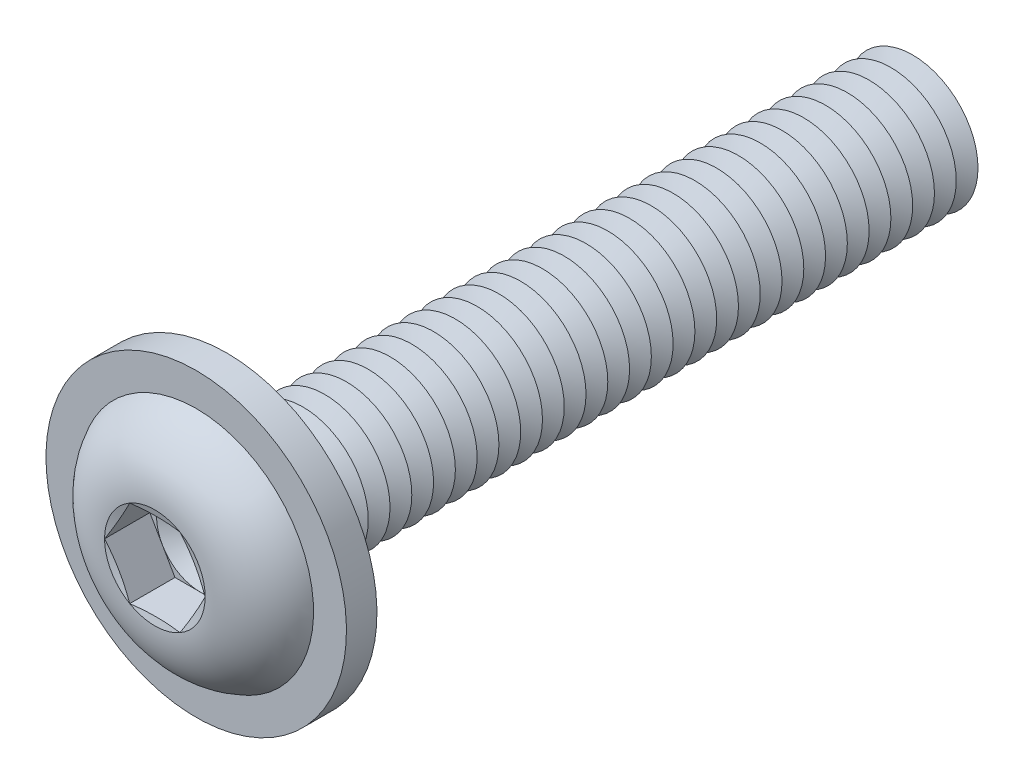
ISO-10303-21;
HEADER;
FILE_DESCRIPTION(('STEP AP214'),'2;1');
FILE_NAME('part.step','',(''),(''),'','','');
FILE_SCHEMA(('AUTOMOTIVE_DESIGN { 1 0 10303 214 1 1 1 1 }'));
ENDSEC;
DATA;
#1=APPLICATION_CONTEXT('core data for automotive mechanical design processes');
#2=APPLICATION_PROTOCOL_DEFINITION('international standard','automotive_design',2000,#1);
#3=PRODUCT_CONTEXT('',#1,'mechanical');
#4=PRODUCT('Part','Part','',(#3));
#5=PRODUCT_RELATED_PRODUCT_CATEGORY('part','',(#4));
#6=PRODUCT_DEFINITION_FORMATION('','',#4);
#7=PRODUCT_DEFINITION_CONTEXT('part definition',#1,'design');
#8=PRODUCT_DEFINITION('design','',#6,#7);
#9=PRODUCT_DEFINITION_SHAPE('','',#8);
#10=(LENGTH_UNIT() NAMED_UNIT(*) SI_UNIT(.MILLI.,.METRE.));
#11=(NAMED_UNIT(*) PLANE_ANGLE_UNIT() SI_UNIT($,.RADIAN.));
#12=(NAMED_UNIT(*) SI_UNIT($,.STERADIAN.) SOLID_ANGLE_UNIT());
#13=UNCERTAINTY_MEASURE_WITH_UNIT(LENGTH_MEASURE(1.E-05),#10,'distance_accuracy_value','');
#14=(GEOMETRIC_REPRESENTATION_CONTEXT(3) GLOBAL_UNCERTAINTY_ASSIGNED_CONTEXT((#13)) GLOBAL_UNIT_ASSIGNED_CONTEXT((#10,
#11,#12)) REPRESENTATION_CONTEXT('',''));
#15=CARTESIAN_POINT('',(0.,0.,0.));
#16=DIRECTION('',(0.,0.,1.));
#17=DIRECTION('',(1.,0.,0.));
#18=AXIS2_PLACEMENT_3D('',#15,#16,#17);
#19=CARTESIAN_POINT('',(0.,0.,-14.25));
#20=DIRECTION('',(0.,0.,1.));
#21=DIRECTION('',(1.,0.,0.));
#22=AXIS2_PLACEMENT_3D('',#19,#20,#21);
#23=CONICAL_SURFACE('',#22,1.5,1.0471975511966);
#24=CARTESIAN_POINT('',(0.,0.,-14.5));
#25=DIRECTION('',(0.,0.,1.));
#26=DIRECTION('',(1.,0.,0.));
#27=AXIS2_PLACEMENT_3D('',#24,#25,#26);
#28=CIRCLE('',#27,1.06698729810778);
#29=CARTESIAN_POINT('',(1.06698729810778,0.,-14.5));
#30=VERTEX_POINT('',#29);
#31=EDGE_CURVE('E465',#30,#30,#28,.T.);
#32=ORIENTED_EDGE('',*,*,#31,.T.);
#33=EDGE_LOOP('',(#32));
#34=FACE_BOUND('',#33,.T.);
#35=CARTESIAN_POINT('',(0.,0.,-14.25));
#36=DIRECTION('',(0.,0.,1.));
#37=DIRECTION('',(1.,0.,0.));
#38=AXIS2_PLACEMENT_3D('',#35,#36,#37);
#39=CIRCLE('',#38,1.5);
#40=CARTESIAN_POINT('',(1.5,0.,-14.25));
#41=VERTEX_POINT('',#40);
#42=EDGE_CURVE('E461',#41,#41,#39,.T.);
#43=ORIENTED_EDGE('',*,*,#42,.F.);
#44=EDGE_LOOP('',(#43));
#45=FACE_BOUND('',#44,.T.);
#46=ADVANCED_FACE('F39',(#34,#45),#23,.T.);
#47=CARTESIAN_POINT('',(0.,0.,-14.5));
#48=DIRECTION('',(0.,0.,-1.));
#49=DIRECTION('',(-1.,0.,0.));
#50=AXIS2_PLACEMENT_3D('',#47,#48,#49);
#51=CONICAL_SURFACE('',#50,1.06698729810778,1.0471975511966);
#52=CARTESIAN_POINT('',(0.,0.,-14.75));
#53=DIRECTION('',(0.,0.,1.));
#54=DIRECTION('',(1.,0.,0.));
#55=AXIS2_PLACEMENT_3D('',#52,#53,#54);
#56=CIRCLE('',#55,1.5);
#57=CARTESIAN_POINT('',(1.5,0.,-14.75));
#58=VERTEX_POINT('',#57);
#59=EDGE_CURVE('E469',#58,#58,#56,.T.);
#60=ORIENTED_EDGE('',*,*,#59,.T.);
#61=EDGE_LOOP('',(#60));
#62=FACE_BOUND('',#61,.T.);
#63=ORIENTED_EDGE('',*,*,#31,.F.);
#64=EDGE_LOOP('',(#63));
#65=FACE_BOUND('',#64,.T.);
#66=ADVANCED_FACE('F602',(#62,#65),#51,.T.);
#67=CARTESIAN_POINT('',(0.,1.50000000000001,-16.));
#68=DIRECTION('',(0.,0.,-1.));
#69=DIRECTION('',(-1.,0.,0.));
#70=AXIS2_PLACEMENT_3D('',#67,#68,#69);
#71=PLANE('',#70);
#72=CARTESIAN_POINT('',(0.,0.,-16.));
#73=DIRECTION('',(0.,0.,1.));
#74=DIRECTION('',(1.,0.,0.));
#75=AXIS2_PLACEMENT_3D('',#72,#73,#74);
#76=CIRCLE('',#75,1.06698729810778);
#77=CARTESIAN_POINT('',(1.06698729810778,0.,-16.));
#78=VERTEX_POINT('',#77);
#79=EDGE_CURVE('E489',#78,#78,#76,.T.);
#80=ORIENTED_EDGE('',*,*,#79,.F.);
#81=EDGE_LOOP('',(#80));
#82=FACE_BOUND('',#81,.T.);
#83=ADVANCED_FACE('F608',(#82),#71,.T.);
#84=CARTESIAN_POINT('',(0.,0.,-15.75));
#85=DIRECTION('',(0.,0.,1.));
#86=DIRECTION('',(1.,0.,0.));
#87=AXIS2_PLACEMENT_3D('',#84,#85,#86);
#88=CONICAL_SURFACE('',#87,1.5,1.0471975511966);
#89=ORIENTED_EDGE('',*,*,#79,.T.);
#90=EDGE_LOOP('',(#89));
#91=FACE_BOUND('',#90,.T.);
#92=CARTESIAN_POINT('',(0.,0.,-15.75));
#93=DIRECTION('',(0.,0.,1.));
#94=DIRECTION('',(1.,0.,0.));
#95=AXIS2_PLACEMENT_3D('',#92,#93,#94);
#96=CIRCLE('',#95,1.5);
#97=CARTESIAN_POINT('',(1.5,0.,-15.75));
#98=VERTEX_POINT('',#97);
#99=EDGE_CURVE('E485',#98,#98,#96,.T.);
#100=ORIENTED_EDGE('',*,*,#99,.F.);
#101=EDGE_LOOP('',(#100));
#102=FACE_BOUND('',#101,.T.);
#103=ADVANCED_FACE('F627',(#91,#102),#88,.T.);
#104=CARTESIAN_POINT('',(0.,0.,-15.5));
#105=DIRECTION('',(0.,0.,-1.));
#106=DIRECTION('',(-1.,0.,0.));
#107=AXIS2_PLACEMENT_3D('',#104,#105,#106);
#108=CONICAL_SURFACE('',#107,1.06698729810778,1.0471975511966);
#109=ORIENTED_EDGE('',*,*,#99,.T.);
#110=EDGE_LOOP('',(#109));
#111=FACE_BOUND('',#110,.T.);
#112=CARTESIAN_POINT('',(0.,0.,-15.5));
#113=DIRECTION('',(0.,0.,1.));
#114=DIRECTION('',(1.,0.,0.));
#115=AXIS2_PLACEMENT_3D('',#112,#113,#114);
#116=CIRCLE('',#115,1.06698729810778);
#117=CARTESIAN_POINT('',(1.06698729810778,0.,-15.5));
#118=VERTEX_POINT('',#117);
#119=EDGE_CURVE('E481',#118,#118,#116,.T.);
#120=ORIENTED_EDGE('',*,*,#119,.F.);
#121=EDGE_LOOP('',(#120));
#122=FACE_BOUND('',#121,.T.);
#123=ADVANCED_FACE('F624',(#111,#122),#108,.T.);
#124=CARTESIAN_POINT('',(0.,0.,-15.25));
#125=DIRECTION('',(0.,0.,1.));
#126=DIRECTION('',(1.,0.,0.));
#127=AXIS2_PLACEMENT_3D('',#124,#125,#126);
#128=CONICAL_SURFACE('',#127,1.5,1.0471975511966);
#129=ORIENTED_EDGE('',*,*,#119,.T.);
#130=EDGE_LOOP('',(#129));
#131=FACE_BOUND('',#130,.T.);
#132=CARTESIAN_POINT('',(0.,0.,-15.25));
#133=DIRECTION('',(0.,0.,1.));
#134=DIRECTION('',(1.,0.,0.));
#135=AXIS2_PLACEMENT_3D('',#132,#133,#134);
#136=CIRCLE('',#135,1.5);
#137=CARTESIAN_POINT('',(1.5,0.,-15.25));
#138=VERTEX_POINT('',#137);
#139=EDGE_CURVE('E477',#138,#138,#136,.T.);
#140=ORIENTED_EDGE('',*,*,#139,.F.);
#141=EDGE_LOOP('',(#140));
#142=FACE_BOUND('',#141,.T.);
#143=ADVANCED_FACE('F618',(#131,#142),#128,.T.);
#144=CARTESIAN_POINT('',(0.,0.,-15.));
#145=DIRECTION('',(0.,0.,-1.));
#146=DIRECTION('',(-1.,0.,0.));
#147=AXIS2_PLACEMENT_3D('',#144,#145,#146);
#148=CONICAL_SURFACE('',#147,1.06698729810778,1.0471975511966);
#149=ORIENTED_EDGE('',*,*,#139,.T.);
#150=EDGE_LOOP('',(#149));
#151=FACE_BOUND('',#150,.T.);
#152=CARTESIAN_POINT('',(0.,0.,-15.));
#153=DIRECTION('',(0.,0.,1.));
#154=DIRECTION('',(1.,0.,0.));
#155=AXIS2_PLACEMENT_3D('',#152,#153,#154);
#156=CIRCLE('',#155,1.06698729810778);
#157=CARTESIAN_POINT('',(1.06698729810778,0.,-15.));
#158=VERTEX_POINT('',#157);
#159=EDGE_CURVE('E473',#158,#158,#156,.T.);
#160=ORIENTED_EDGE('',*,*,#159,.F.);
#161=EDGE_LOOP('',(#160));
#162=FACE_BOUND('',#161,.T.);
#163=ADVANCED_FACE('F614',(#151,#162),#148,.T.);
#164=CARTESIAN_POINT('',(0.,0.,-14.75));
#165=DIRECTION('',(0.,0.,1.));
#166=DIRECTION('',(1.,0.,0.));
#167=AXIS2_PLACEMENT_3D('',#164,#165,#166);
#168=CONICAL_SURFACE('',#167,1.5,1.0471975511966);
#169=ORIENTED_EDGE('',*,*,#159,.T.);
#170=EDGE_LOOP('',(#169));
#171=FACE_BOUND('',#170,.T.);
#172=ORIENTED_EDGE('',*,*,#59,.F.);
#173=EDGE_LOOP('',(#172));
#174=FACE_BOUND('',#173,.T.);
#175=ADVANCED_FACE('F617',(#171,#174),#168,.T.);
#176=CARTESIAN_POINT('',(0.,0.,-13.75));
#177=DIRECTION('',(0.,0.,1.));
#178=DIRECTION('',(1.,0.,0.));
#179=AXIS2_PLACEMENT_3D('',#176,#177,#178);
#180=CONICAL_SURFACE('',#179,1.5,1.0471975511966);
#181=CARTESIAN_POINT('',(0.,0.,-14.));
#182=DIRECTION('',(0.,0.,1.));
#183=DIRECTION('',(1.,0.,0.));
#184=AXIS2_PLACEMENT_3D('',#181,#182,#183);
#185=CIRCLE('',#184,1.06698729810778);
#186=CARTESIAN_POINT('',(1.06698729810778,0.,-14.));
#187=VERTEX_POINT('',#186);
#188=EDGE_CURVE('E457',#187,#187,#185,.T.);
#189=ORIENTED_EDGE('',*,*,#188,.T.);
#190=EDGE_LOOP('',(#189));
#191=FACE_BOUND('',#190,.T.);
#192=CARTESIAN_POINT('',(0.,0.,-13.75));
#193=DIRECTION('',(0.,0.,1.));
#194=DIRECTION('',(1.,0.,0.));
#195=AXIS2_PLACEMENT_3D('',#192,#193,#194);
#196=CIRCLE('',#195,1.5);
#197=CARTESIAN_POINT('',(1.5,0.,-13.75));
#198=VERTEX_POINT('',#197);
#199=EDGE_CURVE('E453',#198,#198,#196,.T.);
#200=ORIENTED_EDGE('',*,*,#199,.F.);
#201=EDGE_LOOP('',(#200));
#202=FACE_BOUND('',#201,.T.);
#203=ADVANCED_FACE('F622',(#191,#202),#180,.T.);
#204=CARTESIAN_POINT('',(0.,0.,-14.));
#205=DIRECTION('',(0.,0.,-1.));
#206=DIRECTION('',(-1.,0.,0.));
#207=AXIS2_PLACEMENT_3D('',#204,#205,#206);
#208=CONICAL_SURFACE('',#207,1.06698729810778,1.0471975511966);
#209=ORIENTED_EDGE('',*,*,#42,.T.);
#210=EDGE_LOOP('',(#209));
#211=FACE_BOUND('',#210,.T.);
#212=ORIENTED_EDGE('',*,*,#188,.F.);
#213=EDGE_LOOP('',(#212));
#214=FACE_BOUND('',#213,.T.);
#215=ADVANCED_FACE('F673',(#211,#214),#208,.T.);
#216=CARTESIAN_POINT('',(0.,0.,-13.25));
#217=DIRECTION('',(0.,0.,1.));
#218=DIRECTION('',(1.,0.,0.));
#219=AXIS2_PLACEMENT_3D('',#216,#217,#218);
#220=CONICAL_SURFACE('',#219,1.5,1.0471975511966);
#221=CARTESIAN_POINT('',(0.,0.,-13.5));
#222=DIRECTION('',(0.,0.,1.));
#223=DIRECTION('',(1.,0.,0.));
#224=AXIS2_PLACEMENT_3D('',#221,#222,#223);
#225=CIRCLE('',#224,1.06698729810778);
#226=CARTESIAN_POINT('',(1.06698729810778,0.,-13.5));
#227=VERTEX_POINT('',#226);
#228=EDGE_CURVE('E449',#227,#227,#225,.T.);
#229=ORIENTED_EDGE('',*,*,#228,.T.);
#230=EDGE_LOOP('',(#229));
#231=FACE_BOUND('',#230,.T.);
#232=CARTESIAN_POINT('',(0.,0.,-13.25));
#233=DIRECTION('',(0.,0.,1.));
#234=DIRECTION('',(1.,0.,0.));
#235=AXIS2_PLACEMENT_3D('',#232,#233,#234);
#236=CIRCLE('',#235,1.5);
#237=CARTESIAN_POINT('',(1.5,0.,-13.25));
#238=VERTEX_POINT('',#237);
#239=EDGE_CURVE('E445',#238,#238,#236,.T.);
#240=ORIENTED_EDGE('',*,*,#239,.F.);
#241=EDGE_LOOP('',(#240));
#242=FACE_BOUND('',#241,.T.);
#243=ADVANCED_FACE('F679',(#231,#242),#220,.T.);
#244=CARTESIAN_POINT('',(0.,0.,-13.5));
#245=DIRECTION('',(0.,0.,-1.));
#246=DIRECTION('',(-1.,0.,0.));
#247=AXIS2_PLACEMENT_3D('',#244,#245,#246);
#248=CONICAL_SURFACE('',#247,1.06698729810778,1.0471975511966);
#249=ORIENTED_EDGE('',*,*,#199,.T.);
#250=EDGE_LOOP('',(#249));
#251=FACE_BOUND('',#250,.T.);
#252=ORIENTED_EDGE('',*,*,#228,.F.);
#253=EDGE_LOOP('',(#252));
#254=FACE_BOUND('',#253,.T.);
#255=ADVANCED_FACE('F686',(#251,#254),#248,.T.);
#256=CARTESIAN_POINT('',(0.,0.,-12.75));
#257=DIRECTION('',(0.,0.,1.));
#258=DIRECTION('',(1.,0.,0.));
#259=AXIS2_PLACEMENT_3D('',#256,#257,#258);
#260=CONICAL_SURFACE('',#259,1.5,1.0471975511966);
#261=CARTESIAN_POINT('',(0.,0.,-13.));
#262=DIRECTION('',(0.,0.,1.));
#263=DIRECTION('',(1.,0.,0.));
#264=AXIS2_PLACEMENT_3D('',#261,#262,#263);
#265=CIRCLE('',#264,1.06698729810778);
#266=CARTESIAN_POINT('',(1.06698729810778,0.,-13.));
#267=VERTEX_POINT('',#266);
#268=EDGE_CURVE('E441',#267,#267,#265,.T.);
#269=ORIENTED_EDGE('',*,*,#268,.T.);
#270=EDGE_LOOP('',(#269));
#271=FACE_BOUND('',#270,.T.);
#272=CARTESIAN_POINT('',(0.,0.,-12.75));
#273=DIRECTION('',(0.,0.,1.));
#274=DIRECTION('',(1.,0.,0.));
#275=AXIS2_PLACEMENT_3D('',#272,#273,#274);
#276=CIRCLE('',#275,1.5);
#277=CARTESIAN_POINT('',(1.5,0.,-12.75));
#278=VERTEX_POINT('',#277);
#279=EDGE_CURVE('E437',#278,#278,#276,.T.);
#280=ORIENTED_EDGE('',*,*,#279,.F.);
#281=EDGE_LOOP('',(#280));
#282=FACE_BOUND('',#281,.T.);
#283=ADVANCED_FACE('F693',(#271,#282),#260,.T.);
#284=CARTESIAN_POINT('',(0.,0.,-13.));
#285=DIRECTION('',(0.,0.,-1.));
#286=DIRECTION('',(-1.,0.,0.));
#287=AXIS2_PLACEMENT_3D('',#284,#285,#286);
#288=CONICAL_SURFACE('',#287,1.06698729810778,1.0471975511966);
#289=ORIENTED_EDGE('',*,*,#239,.T.);
#290=EDGE_LOOP('',(#289));
#291=FACE_BOUND('',#290,.T.);
#292=ORIENTED_EDGE('',*,*,#268,.F.);
#293=EDGE_LOOP('',(#292));
#294=FACE_BOUND('',#293,.T.);
#295=ADVANCED_FACE('F700',(#291,#294),#288,.T.);
#296=CARTESIAN_POINT('',(0.,0.,-12.25));
#297=DIRECTION('',(0.,0.,1.));
#298=DIRECTION('',(1.,0.,0.));
#299=AXIS2_PLACEMENT_3D('',#296,#297,#298);
#300=CONICAL_SURFACE('',#299,1.5,1.0471975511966);
#301=CARTESIAN_POINT('',(0.,0.,-12.5));
#302=DIRECTION('',(0.,0.,1.));
#303=DIRECTION('',(1.,0.,0.));
#304=AXIS2_PLACEMENT_3D('',#301,#302,#303);
#305=CIRCLE('',#304,1.06698729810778);
#306=CARTESIAN_POINT('',(1.06698729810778,0.,-12.5));
#307=VERTEX_POINT('',#306);
#308=EDGE_CURVE('E433',#307,#307,#305,.T.);
#309=ORIENTED_EDGE('',*,*,#308,.T.);
#310=EDGE_LOOP('',(#309));
#311=FACE_BOUND('',#310,.T.);
#312=CARTESIAN_POINT('',(0.,0.,-12.25));
#313=DIRECTION('',(0.,0.,1.));
#314=DIRECTION('',(1.,0.,0.));
#315=AXIS2_PLACEMENT_3D('',#312,#313,#314);
#316=CIRCLE('',#315,1.5);
#317=CARTESIAN_POINT('',(1.5,0.,-12.25));
#318=VERTEX_POINT('',#317);
#319=EDGE_CURVE('E429',#318,#318,#316,.T.);
#320=ORIENTED_EDGE('',*,*,#319,.F.);
#321=EDGE_LOOP('',(#320));
#322=FACE_BOUND('',#321,.T.);
#323=ADVANCED_FACE('F707',(#311,#322),#300,.T.);
#324=CARTESIAN_POINT('',(0.,0.,-12.5));
#325=DIRECTION('',(0.,0.,-1.));
#326=DIRECTION('',(-1.,0.,0.));
#327=AXIS2_PLACEMENT_3D('',#324,#325,#326);
#328=CONICAL_SURFACE('',#327,1.06698729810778,1.0471975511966);
#329=ORIENTED_EDGE('',*,*,#279,.T.);
#330=EDGE_LOOP('',(#329));
#331=FACE_BOUND('',#330,.T.);
#332=ORIENTED_EDGE('',*,*,#308,.F.);
#333=EDGE_LOOP('',(#332));
#334=FACE_BOUND('',#333,.T.);
#335=ADVANCED_FACE('F714',(#331,#334),#328,.T.);
#336=CARTESIAN_POINT('',(0.,0.,-11.75));
#337=DIRECTION('',(0.,0.,1.));
#338=DIRECTION('',(1.,0.,0.));
#339=AXIS2_PLACEMENT_3D('',#336,#337,#338);
#340=CONICAL_SURFACE('',#339,1.5,1.0471975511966);
#341=CARTESIAN_POINT('',(0.,0.,-12.));
#342=DIRECTION('',(0.,0.,1.));
#343=DIRECTION('',(1.,0.,0.));
#344=AXIS2_PLACEMENT_3D('',#341,#342,#343);
#345=CIRCLE('',#344,1.06698729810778);
#346=CARTESIAN_POINT('',(1.06698729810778,0.,-12.));
#347=VERTEX_POINT('',#346);
#348=EDGE_CURVE('E425',#347,#347,#345,.T.);
#349=ORIENTED_EDGE('',*,*,#348,.T.);
#350=EDGE_LOOP('',(#349));
#351=FACE_BOUND('',#350,.T.);
#352=CARTESIAN_POINT('',(0.,0.,-11.75));
#353=DIRECTION('',(0.,0.,1.));
#354=DIRECTION('',(1.,0.,0.));
#355=AXIS2_PLACEMENT_3D('',#352,#353,#354);
#356=CIRCLE('',#355,1.5);
#357=CARTESIAN_POINT('',(1.5,0.,-11.75));
#358=VERTEX_POINT('',#357);
#359=EDGE_CURVE('E422',#358,#358,#356,.T.);
#360=ORIENTED_EDGE('',*,*,#359,.F.);
#361=EDGE_LOOP('',(#360));
#362=FACE_BOUND('',#361,.T.);
#363=ADVANCED_FACE('F721',(#351,#362),#340,.T.);
#364=CARTESIAN_POINT('',(0.,0.,-12.));
#365=DIRECTION('',(0.,0.,-1.));
#366=DIRECTION('',(-1.,0.,0.));
#367=AXIS2_PLACEMENT_3D('',#364,#365,#366);
#368=CONICAL_SURFACE('',#367,1.06698729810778,1.0471975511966);
#369=ORIENTED_EDGE('',*,*,#319,.T.);
#370=EDGE_LOOP('',(#369));
#371=FACE_BOUND('',#370,.T.);
#372=ORIENTED_EDGE('',*,*,#348,.F.);
#373=EDGE_LOOP('',(#372));
#374=FACE_BOUND('',#373,.T.);
#375=ADVANCED_FACE('F728',(#371,#374),#368,.T.);
#376=CARTESIAN_POINT('',(0.,0.,-11.25));
#377=DIRECTION('',(0.,0.,1.));
#378=DIRECTION('',(1.,0.,0.));
#379=AXIS2_PLACEMENT_3D('',#376,#377,#378);
#380=CONICAL_SURFACE('',#379,1.5,1.0471975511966);
#381=CARTESIAN_POINT('',(0.,0.,-11.5));
#382=DIRECTION('',(0.,0.,1.));
#383=DIRECTION('',(1.,0.,0.));
#384=AXIS2_PLACEMENT_3D('',#381,#382,#383);
#385=CIRCLE('',#384,1.06698729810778);
#386=CARTESIAN_POINT('',(1.06698729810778,0.,-11.5));
#387=VERTEX_POINT('',#386);
#388=EDGE_CURVE('E418',#387,#387,#385,.T.);
#389=ORIENTED_EDGE('',*,*,#388,.T.);
#390=EDGE_LOOP('',(#389));
#391=FACE_BOUND('',#390,.T.);
#392=CARTESIAN_POINT('',(0.,0.,-11.25));
#393=DIRECTION('',(0.,0.,1.));
#394=DIRECTION('',(1.,0.,0.));
#395=AXIS2_PLACEMENT_3D('',#392,#393,#394);
#396=CIRCLE('',#395,1.5);
#397=CARTESIAN_POINT('',(1.5,0.,-11.25));
#398=VERTEX_POINT('',#397);
#399=EDGE_CURVE('E414',#398,#398,#396,.T.);
#400=ORIENTED_EDGE('',*,*,#399,.F.);
#401=EDGE_LOOP('',(#400));
#402=FACE_BOUND('',#401,.T.);
#403=ADVANCED_FACE('F735',(#391,#402),#380,.T.);
#404=CARTESIAN_POINT('',(0.,0.,-11.5));
#405=DIRECTION('',(0.,0.,-1.));
#406=DIRECTION('',(-1.,0.,0.));
#407=AXIS2_PLACEMENT_3D('',#404,#405,#406);
#408=CONICAL_SURFACE('',#407,1.06698729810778,1.0471975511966);
#409=ORIENTED_EDGE('',*,*,#359,.T.);
#410=EDGE_LOOP('',(#409));
#411=FACE_BOUND('',#410,.T.);
#412=ORIENTED_EDGE('',*,*,#388,.F.);
#413=EDGE_LOOP('',(#412));
#414=FACE_BOUND('',#413,.T.);
#415=ADVANCED_FACE('F742',(#411,#414),#408,.T.);
#416=CARTESIAN_POINT('',(0.,0.,-10.75));
#417=DIRECTION('',(0.,0.,1.));
#418=DIRECTION('',(1.,0.,0.));
#419=AXIS2_PLACEMENT_3D('',#416,#417,#418);
#420=CONICAL_SURFACE('',#419,1.5,1.0471975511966);
#421=CARTESIAN_POINT('',(0.,0.,-11.));
#422=DIRECTION('',(0.,0.,1.));
#423=DIRECTION('',(1.,0.,0.));
#424=AXIS2_PLACEMENT_3D('',#421,#422,#423);
#425=CIRCLE('',#424,1.06698729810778);
#426=CARTESIAN_POINT('',(1.06698729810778,0.,-11.));
#427=VERTEX_POINT('',#426);
#428=EDGE_CURVE('E410',#427,#427,#425,.T.);
#429=ORIENTED_EDGE('',*,*,#428,.T.);
#430=EDGE_LOOP('',(#429));
#431=FACE_BOUND('',#430,.T.);
#432=CARTESIAN_POINT('',(0.,0.,-10.75));
#433=DIRECTION('',(0.,0.,1.));
#434=DIRECTION('',(1.,0.,0.));
#435=AXIS2_PLACEMENT_3D('',#432,#433,#434);
#436=CIRCLE('',#435,1.5);
#437=CARTESIAN_POINT('',(1.5,0.,-10.75));
#438=VERTEX_POINT('',#437);
#439=EDGE_CURVE('E406',#438,#438,#436,.T.);
#440=ORIENTED_EDGE('',*,*,#439,.F.);
#441=EDGE_LOOP('',(#440));
#442=FACE_BOUND('',#441,.T.);
#443=ADVANCED_FACE('F749',(#431,#442),#420,.T.);
#444=CARTESIAN_POINT('',(0.,0.,-11.));
#445=DIRECTION('',(0.,0.,-1.));
#446=DIRECTION('',(-1.,0.,0.));
#447=AXIS2_PLACEMENT_3D('',#444,#445,#446);
#448=CONICAL_SURFACE('',#447,1.06698729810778,1.0471975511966);
#449=ORIENTED_EDGE('',*,*,#399,.T.);
#450=EDGE_LOOP('',(#449));
#451=FACE_BOUND('',#450,.T.);
#452=ORIENTED_EDGE('',*,*,#428,.F.);
#453=EDGE_LOOP('',(#452));
#454=FACE_BOUND('',#453,.T.);
#455=ADVANCED_FACE('F756',(#451,#454),#448,.T.);
#456=CARTESIAN_POINT('',(0.,0.,-10.25));
#457=DIRECTION('',(0.,0.,1.));
#458=DIRECTION('',(1.,0.,0.));
#459=AXIS2_PLACEMENT_3D('',#456,#457,#458);
#460=CONICAL_SURFACE('',#459,1.5,1.0471975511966);
#461=CARTESIAN_POINT('',(0.,0.,-10.5));
#462=DIRECTION('',(0.,0.,1.));
#463=DIRECTION('',(1.,0.,0.));
#464=AXIS2_PLACEMENT_3D('',#461,#462,#463);
#465=CIRCLE('',#464,1.06698729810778);
#466=CARTESIAN_POINT('',(1.06698729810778,0.,-10.5));
#467=VERTEX_POINT('',#466);
#468=EDGE_CURVE('E402',#467,#467,#465,.T.);
#469=ORIENTED_EDGE('',*,*,#468,.T.);
#470=EDGE_LOOP('',(#469));
#471=FACE_BOUND('',#470,.T.);
#472=CARTESIAN_POINT('',(0.,0.,-10.25));
#473=DIRECTION('',(0.,0.,1.));
#474=DIRECTION('',(1.,0.,0.));
#475=AXIS2_PLACEMENT_3D('',#472,#473,#474);
#476=CIRCLE('',#475,1.5);
#477=CARTESIAN_POINT('',(1.5,0.,-10.25));
#478=VERTEX_POINT('',#477);
#479=EDGE_CURVE('E398',#478,#478,#476,.T.);
#480=ORIENTED_EDGE('',*,*,#479,.F.);
#481=EDGE_LOOP('',(#480));
#482=FACE_BOUND('',#481,.T.);
#483=ADVANCED_FACE('F763',(#471,#482),#460,.T.);
#484=CARTESIAN_POINT('',(0.,0.,-10.5));
#485=DIRECTION('',(0.,0.,-1.));
#486=DIRECTION('',(-1.,0.,0.));
#487=AXIS2_PLACEMENT_3D('',#484,#485,#486);
#488=CONICAL_SURFACE('',#487,1.06698729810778,1.0471975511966);
#489=ORIENTED_EDGE('',*,*,#439,.T.);
#490=EDGE_LOOP('',(#489));
#491=FACE_BOUND('',#490,.T.);
#492=ORIENTED_EDGE('',*,*,#468,.F.);
#493=EDGE_LOOP('',(#492));
#494=FACE_BOUND('',#493,.T.);
#495=ADVANCED_FACE('F770',(#491,#494),#488,.T.);
#496=CARTESIAN_POINT('',(0.,0.,-9.75));
#497=DIRECTION('',(0.,0.,1.));
#498=DIRECTION('',(1.,0.,0.));
#499=AXIS2_PLACEMENT_3D('',#496,#497,#498);
#500=CONICAL_SURFACE('',#499,1.5,1.0471975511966);
#501=CARTESIAN_POINT('',(0.,0.,-10.));
#502=DIRECTION('',(0.,0.,1.));
#503=DIRECTION('',(1.,0.,0.));
#504=AXIS2_PLACEMENT_3D('',#501,#502,#503);
#505=CIRCLE('',#504,1.06698729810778);
#506=CARTESIAN_POINT('',(1.06698729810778,0.,-10.));
#507=VERTEX_POINT('',#506);
#508=EDGE_CURVE('E394',#507,#507,#505,.T.);
#509=ORIENTED_EDGE('',*,*,#508,.T.);
#510=EDGE_LOOP('',(#509));
#511=FACE_BOUND('',#510,.T.);
#512=CARTESIAN_POINT('',(0.,0.,-9.75));
#513=DIRECTION('',(0.,0.,1.));
#514=DIRECTION('',(1.,0.,0.));
#515=AXIS2_PLACEMENT_3D('',#512,#513,#514);
#516=CIRCLE('',#515,1.5);
#517=CARTESIAN_POINT('',(1.5,0.,-9.75));
#518=VERTEX_POINT('',#517);
#519=EDGE_CURVE('E390',#518,#518,#516,.T.);
#520=ORIENTED_EDGE('',*,*,#519,.F.);
#521=EDGE_LOOP('',(#520));
#522=FACE_BOUND('',#521,.T.);
#523=ADVANCED_FACE('F777',(#511,#522),#500,.T.);
#524=CARTESIAN_POINT('',(0.,0.,-10.));
#525=DIRECTION('',(0.,0.,-1.));
#526=DIRECTION('',(-1.,0.,0.));
#527=AXIS2_PLACEMENT_3D('',#524,#525,#526);
#528=CONICAL_SURFACE('',#527,1.06698729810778,1.0471975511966);
#529=ORIENTED_EDGE('',*,*,#479,.T.);
#530=EDGE_LOOP('',(#529));
#531=FACE_BOUND('',#530,.T.);
#532=ORIENTED_EDGE('',*,*,#508,.F.);
#533=EDGE_LOOP('',(#532));
#534=FACE_BOUND('',#533,.T.);
#535=ADVANCED_FACE('F784',(#531,#534),#528,.T.);
#536=CARTESIAN_POINT('',(0.,0.,-9.25));
#537=DIRECTION('',(0.,0.,1.));
#538=DIRECTION('',(1.,0.,0.));
#539=AXIS2_PLACEMENT_3D('',#536,#537,#538);
#540=CONICAL_SURFACE('',#539,1.5,1.0471975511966);
#541=CARTESIAN_POINT('',(0.,0.,-9.5));
#542=DIRECTION('',(0.,0.,1.));
#543=DIRECTION('',(1.,0.,0.));
#544=AXIS2_PLACEMENT_3D('',#541,#542,#543);
#545=CIRCLE('',#544,1.06698729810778);
#546=CARTESIAN_POINT('',(1.06698729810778,0.,-9.5));
#547=VERTEX_POINT('',#546);
#548=EDGE_CURVE('E386',#547,#547,#545,.T.);
#549=ORIENTED_EDGE('',*,*,#548,.T.);
#550=EDGE_LOOP('',(#549));
#551=FACE_BOUND('',#550,.T.);
#552=CARTESIAN_POINT('',(0.,0.,-9.25));
#553=DIRECTION('',(0.,0.,1.));
#554=DIRECTION('',(1.,0.,0.));
#555=AXIS2_PLACEMENT_3D('',#552,#553,#554);
#556=CIRCLE('',#555,1.5);
#557=CARTESIAN_POINT('',(1.5,0.,-9.25));
#558=VERTEX_POINT('',#557);
#559=EDGE_CURVE('E382',#558,#558,#556,.T.);
#560=ORIENTED_EDGE('',*,*,#559,.F.);
#561=EDGE_LOOP('',(#560));
#562=FACE_BOUND('',#561,.T.);
#563=ADVANCED_FACE('F791',(#551,#562),#540,.T.);
#564=CARTESIAN_POINT('',(0.,0.,-9.5));
#565=DIRECTION('',(0.,0.,-1.));
#566=DIRECTION('',(-1.,0.,0.));
#567=AXIS2_PLACEMENT_3D('',#564,#565,#566);
#568=CONICAL_SURFACE('',#567,1.06698729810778,1.0471975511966);
#569=ORIENTED_EDGE('',*,*,#519,.T.);
#570=EDGE_LOOP('',(#569));
#571=FACE_BOUND('',#570,.T.);
#572=ORIENTED_EDGE('',*,*,#548,.F.);
#573=EDGE_LOOP('',(#572));
#574=FACE_BOUND('',#573,.T.);
#575=ADVANCED_FACE('F798',(#571,#574),#568,.T.);
#576=CARTESIAN_POINT('',(0.,0.,-8.75));
#577=DIRECTION('',(0.,0.,1.));
#578=DIRECTION('',(1.,0.,0.));
#579=AXIS2_PLACEMENT_3D('',#576,#577,#578);
#580=CONICAL_SURFACE('',#579,1.5,1.0471975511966);
#581=CARTESIAN_POINT('',(0.,0.,-9.));
#582=DIRECTION('',(0.,0.,1.));
#583=DIRECTION('',(1.,0.,0.));
#584=AXIS2_PLACEMENT_3D('',#581,#582,#583);
#585=CIRCLE('',#584,1.06698729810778);
#586=CARTESIAN_POINT('',(1.06698729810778,0.,-9.));
#587=VERTEX_POINT('',#586);
#588=EDGE_CURVE('E378',#587,#587,#585,.T.);
#589=ORIENTED_EDGE('',*,*,#588,.T.);
#590=EDGE_LOOP('',(#589));
#591=FACE_BOUND('',#590,.T.);
#592=CARTESIAN_POINT('',(0.,0.,-8.75));
#593=DIRECTION('',(0.,0.,1.));
#594=DIRECTION('',(1.,0.,0.));
#595=AXIS2_PLACEMENT_3D('',#592,#593,#594);
#596=CIRCLE('',#595,1.5);
#597=CARTESIAN_POINT('',(1.5,0.,-8.75));
#598=VERTEX_POINT('',#597);
#599=EDGE_CURVE('E374',#598,#598,#596,.T.);
#600=ORIENTED_EDGE('',*,*,#599,.F.);
#601=EDGE_LOOP('',(#600));
#602=FACE_BOUND('',#601,.T.);
#603=ADVANCED_FACE('F805',(#591,#602),#580,.T.);
#604=CARTESIAN_POINT('',(0.,0.,-9.));
#605=DIRECTION('',(0.,0.,-1.));
#606=DIRECTION('',(-1.,0.,0.));
#607=AXIS2_PLACEMENT_3D('',#604,#605,#606);
#608=CONICAL_SURFACE('',#607,1.06698729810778,1.0471975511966);
#609=ORIENTED_EDGE('',*,*,#559,.T.);
#610=EDGE_LOOP('',(#609));
#611=FACE_BOUND('',#610,.T.);
#612=ORIENTED_EDGE('',*,*,#588,.F.);
#613=EDGE_LOOP('',(#612));
#614=FACE_BOUND('',#613,.T.);
#615=ADVANCED_FACE('F812',(#611,#614),#608,.T.);
#616=CARTESIAN_POINT('',(0.,0.,-8.25));
#617=DIRECTION('',(0.,0.,1.));
#618=DIRECTION('',(1.,0.,0.));
#619=AXIS2_PLACEMENT_3D('',#616,#617,#618);
#620=CONICAL_SURFACE('',#619,1.5,1.0471975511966);
#621=CARTESIAN_POINT('',(0.,0.,-8.5));
#622=DIRECTION('',(0.,0.,1.));
#623=DIRECTION('',(1.,0.,0.));
#624=AXIS2_PLACEMENT_3D('',#621,#622,#623);
#625=CIRCLE('',#624,1.06698729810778);
#626=CARTESIAN_POINT('',(1.06698729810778,0.,-8.5));
#627=VERTEX_POINT('',#626);
#628=EDGE_CURVE('E370',#627,#627,#625,.T.);
#629=ORIENTED_EDGE('',*,*,#628,.T.);
#630=EDGE_LOOP('',(#629));
#631=FACE_BOUND('',#630,.T.);
#632=CARTESIAN_POINT('',(0.,0.,-8.25));
#633=DIRECTION('',(0.,0.,1.));
#634=DIRECTION('',(1.,0.,0.));
#635=AXIS2_PLACEMENT_3D('',#632,#633,#634);
#636=CIRCLE('',#635,1.5);
#637=CARTESIAN_POINT('',(1.5,0.,-8.25));
#638=VERTEX_POINT('',#637);
#639=EDGE_CURVE('E366',#638,#638,#636,.T.);
#640=ORIENTED_EDGE('',*,*,#639,.F.);
#641=EDGE_LOOP('',(#640));
#642=FACE_BOUND('',#641,.T.);
#643=ADVANCED_FACE('F819',(#631,#642),#620,.T.);
#644=CARTESIAN_POINT('',(0.,0.,-8.5));
#645=DIRECTION('',(0.,0.,-1.));
#646=DIRECTION('',(-1.,0.,0.));
#647=AXIS2_PLACEMENT_3D('',#644,#645,#646);
#648=CONICAL_SURFACE('',#647,1.06698729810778,1.0471975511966);
#649=ORIENTED_EDGE('',*,*,#599,.T.);
#650=EDGE_LOOP('',(#649));
#651=FACE_BOUND('',#650,.T.);
#652=ORIENTED_EDGE('',*,*,#628,.F.);
#653=EDGE_LOOP('',(#652));
#654=FACE_BOUND('',#653,.T.);
#655=ADVANCED_FACE('F826',(#651,#654),#648,.T.);
#656=CARTESIAN_POINT('',(0.,0.,-7.75));
#657=DIRECTION('',(0.,0.,1.));
#658=DIRECTION('',(1.,0.,0.));
#659=AXIS2_PLACEMENT_3D('',#656,#657,#658);
#660=CONICAL_SURFACE('',#659,1.5,1.0471975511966);
#661=CARTESIAN_POINT('',(0.,0.,-8.));
#662=DIRECTION('',(0.,0.,1.));
#663=DIRECTION('',(1.,0.,0.));
#664=AXIS2_PLACEMENT_3D('',#661,#662,#663);
#665=CIRCLE('',#664,1.06698729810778);
#666=CARTESIAN_POINT('',(1.06698729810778,0.,-8.));
#667=VERTEX_POINT('',#666);
#668=EDGE_CURVE('E362',#667,#667,#665,.T.);
#669=ORIENTED_EDGE('',*,*,#668,.T.);
#670=EDGE_LOOP('',(#669));
#671=FACE_BOUND('',#670,.T.);
#672=CARTESIAN_POINT('',(0.,0.,-7.75));
#673=DIRECTION('',(0.,0.,1.));
#674=DIRECTION('',(1.,0.,0.));
#675=AXIS2_PLACEMENT_3D('',#672,#673,#674);
#676=CIRCLE('',#675,1.5);
#677=CARTESIAN_POINT('',(1.5,0.,-7.75));
#678=VERTEX_POINT('',#677);
#679=EDGE_CURVE('E358',#678,#678,#676,.T.);
#680=ORIENTED_EDGE('',*,*,#679,.F.);
#681=EDGE_LOOP('',(#680));
#682=FACE_BOUND('',#681,.T.);
#683=ADVANCED_FACE('F833',(#671,#682),#660,.T.);
#684=CARTESIAN_POINT('',(0.,0.,-8.));
#685=DIRECTION('',(0.,0.,-1.));
#686=DIRECTION('',(-1.,0.,0.));
#687=AXIS2_PLACEMENT_3D('',#684,#685,#686);
#688=CONICAL_SURFACE('',#687,1.06698729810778,1.0471975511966);
#689=ORIENTED_EDGE('',*,*,#639,.T.);
#690=EDGE_LOOP('',(#689));
#691=FACE_BOUND('',#690,.T.);
#692=ORIENTED_EDGE('',*,*,#668,.F.);
#693=EDGE_LOOP('',(#692));
#694=FACE_BOUND('',#693,.T.);
#695=ADVANCED_FACE('F840',(#691,#694),#688,.T.);
#696=CARTESIAN_POINT('',(0.,0.,-7.25));
#697=DIRECTION('',(0.,0.,1.));
#698=DIRECTION('',(1.,0.,0.));
#699=AXIS2_PLACEMENT_3D('',#696,#697,#698);
#700=CONICAL_SURFACE('',#699,1.5,1.0471975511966);
#701=CARTESIAN_POINT('',(0.,0.,-7.5));
#702=DIRECTION('',(0.,0.,1.));
#703=DIRECTION('',(1.,0.,0.));
#704=AXIS2_PLACEMENT_3D('',#701,#702,#703);
#705=CIRCLE('',#704,1.06698729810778);
#706=CARTESIAN_POINT('',(1.06698729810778,0.,-7.5));
#707=VERTEX_POINT('',#706);
#708=EDGE_CURVE('E354',#707,#707,#705,.T.);
#709=ORIENTED_EDGE('',*,*,#708,.T.);
#710=EDGE_LOOP('',(#709));
#711=FACE_BOUND('',#710,.T.);
#712=CARTESIAN_POINT('',(0.,0.,-7.25));
#713=DIRECTION('',(0.,0.,1.));
#714=DIRECTION('',(1.,0.,0.));
#715=AXIS2_PLACEMENT_3D('',#712,#713,#714);
#716=CIRCLE('',#715,1.5);
#717=CARTESIAN_POINT('',(1.5,0.,-7.25));
#718=VERTEX_POINT('',#717);
#719=EDGE_CURVE('E350',#718,#718,#716,.T.);
#720=ORIENTED_EDGE('',*,*,#719,.F.);
#721=EDGE_LOOP('',(#720));
#722=FACE_BOUND('',#721,.T.);
#723=ADVANCED_FACE('F847',(#711,#722),#700,.T.);
#724=CARTESIAN_POINT('',(0.,0.,-7.5));
#725=DIRECTION('',(0.,0.,-1.));
#726=DIRECTION('',(-1.,0.,0.));
#727=AXIS2_PLACEMENT_3D('',#724,#725,#726);
#728=CONICAL_SURFACE('',#727,1.06698729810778,1.0471975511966);
#729=ORIENTED_EDGE('',*,*,#679,.T.);
#730=EDGE_LOOP('',(#729));
#731=FACE_BOUND('',#730,.T.);
#732=ORIENTED_EDGE('',*,*,#708,.F.);
#733=EDGE_LOOP('',(#732));
#734=FACE_BOUND('',#733,.T.);
#735=ADVANCED_FACE('F854',(#731,#734),#728,.T.);
#736=CARTESIAN_POINT('',(0.,0.,-6.75));
#737=DIRECTION('',(0.,0.,1.));
#738=DIRECTION('',(1.,0.,0.));
#739=AXIS2_PLACEMENT_3D('',#736,#737,#738);
#740=CONICAL_SURFACE('',#739,1.5,1.0471975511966);
#741=CARTESIAN_POINT('',(0.,0.,-7.));
#742=DIRECTION('',(0.,0.,1.));
#743=DIRECTION('',(1.,0.,0.));
#744=AXIS2_PLACEMENT_3D('',#741,#742,#743);
#745=CIRCLE('',#744,1.06698729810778);
#746=CARTESIAN_POINT('',(1.06698729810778,0.,-7.));
#747=VERTEX_POINT('',#746);
#748=EDGE_CURVE('E346',#747,#747,#745,.T.);
#749=ORIENTED_EDGE('',*,*,#748,.T.);
#750=EDGE_LOOP('',(#749));
#751=FACE_BOUND('',#750,.T.);
#752=CARTESIAN_POINT('',(0.,0.,-6.75));
#753=DIRECTION('',(0.,0.,1.));
#754=DIRECTION('',(1.,0.,0.));
#755=AXIS2_PLACEMENT_3D('',#752,#753,#754);
#756=CIRCLE('',#755,1.5);
#757=CARTESIAN_POINT('',(1.5,0.,-6.75));
#758=VERTEX_POINT('',#757);
#759=EDGE_CURVE('E342',#758,#758,#756,.T.);
#760=ORIENTED_EDGE('',*,*,#759,.F.);
#761=EDGE_LOOP('',(#760));
#762=FACE_BOUND('',#761,.T.);
#763=ADVANCED_FACE('F861',(#751,#762),#740,.T.);
#764=CARTESIAN_POINT('',(0.,0.,-7.));
#765=DIRECTION('',(0.,0.,-1.));
#766=DIRECTION('',(-1.,0.,0.));
#767=AXIS2_PLACEMENT_3D('',#764,#765,#766);
#768=CONICAL_SURFACE('',#767,1.06698729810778,1.0471975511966);
#769=ORIENTED_EDGE('',*,*,#719,.T.);
#770=EDGE_LOOP('',(#769));
#771=FACE_BOUND('',#770,.T.);
#772=ORIENTED_EDGE('',*,*,#748,.F.);
#773=EDGE_LOOP('',(#772));
#774=FACE_BOUND('',#773,.T.);
#775=ADVANCED_FACE('F868',(#771,#774),#768,.T.);
#776=CARTESIAN_POINT('',(0.,0.,-6.25));
#777=DIRECTION('',(0.,0.,1.));
#778=DIRECTION('',(1.,0.,0.));
#779=AXIS2_PLACEMENT_3D('',#776,#777,#778);
#780=CONICAL_SURFACE('',#779,1.5,1.0471975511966);
#781=CARTESIAN_POINT('',(0.,0.,-6.5));
#782=DIRECTION('',(0.,0.,1.));
#783=DIRECTION('',(1.,0.,0.));
#784=AXIS2_PLACEMENT_3D('',#781,#782,#783);
#785=CIRCLE('',#784,1.06698729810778);
#786=CARTESIAN_POINT('',(1.06698729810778,0.,-6.5));
#787=VERTEX_POINT('',#786);
#788=EDGE_CURVE('E338',#787,#787,#785,.T.);
#789=ORIENTED_EDGE('',*,*,#788,.T.);
#790=EDGE_LOOP('',(#789));
#791=FACE_BOUND('',#790,.T.);
#792=CARTESIAN_POINT('',(0.,0.,-6.25));
#793=DIRECTION('',(0.,0.,1.));
#794=DIRECTION('',(1.,0.,0.));
#795=AXIS2_PLACEMENT_3D('',#792,#793,#794);
#796=CIRCLE('',#795,1.5);
#797=CARTESIAN_POINT('',(1.5,0.,-6.25));
#798=VERTEX_POINT('',#797);
#799=EDGE_CURVE('E334',#798,#798,#796,.T.);
#800=ORIENTED_EDGE('',*,*,#799,.F.);
#801=EDGE_LOOP('',(#800));
#802=FACE_BOUND('',#801,.T.);
#803=ADVANCED_FACE('F875',(#791,#802),#780,.T.);
#804=CARTESIAN_POINT('',(0.,0.,-6.5));
#805=DIRECTION('',(0.,0.,-1.));
#806=DIRECTION('',(-1.,0.,0.));
#807=AXIS2_PLACEMENT_3D('',#804,#805,#806);
#808=CONICAL_SURFACE('',#807,1.06698729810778,1.0471975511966);
#809=ORIENTED_EDGE('',*,*,#759,.T.);
#810=EDGE_LOOP('',(#809));
#811=FACE_BOUND('',#810,.T.);
#812=ORIENTED_EDGE('',*,*,#788,.F.);
#813=EDGE_LOOP('',(#812));
#814=FACE_BOUND('',#813,.T.);
#815=ADVANCED_FACE('F882',(#811,#814),#808,.T.);
#816=CARTESIAN_POINT('',(0.,0.,-5.75));
#817=DIRECTION('',(0.,0.,1.));
#818=DIRECTION('',(1.,0.,0.));
#819=AXIS2_PLACEMENT_3D('',#816,#817,#818);
#820=CONICAL_SURFACE('',#819,1.5,1.0471975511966);
#821=CARTESIAN_POINT('',(0.,0.,-6.));
#822=DIRECTION('',(0.,0.,1.));
#823=DIRECTION('',(1.,0.,0.));
#824=AXIS2_PLACEMENT_3D('',#821,#822,#823);
#825=CIRCLE('',#824,1.06698729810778);
#826=CARTESIAN_POINT('',(1.06698729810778,0.,-6.));
#827=VERTEX_POINT('',#826);
#828=EDGE_CURVE('E330',#827,#827,#825,.T.);
#829=ORIENTED_EDGE('',*,*,#828,.T.);
#830=EDGE_LOOP('',(#829));
#831=FACE_BOUND('',#830,.T.);
#832=CARTESIAN_POINT('',(0.,0.,-5.75));
#833=DIRECTION('',(0.,0.,1.));
#834=DIRECTION('',(1.,0.,0.));
#835=AXIS2_PLACEMENT_3D('',#832,#833,#834);
#836=CIRCLE('',#835,1.5);
#837=CARTESIAN_POINT('',(1.5,0.,-5.75));
#838=VERTEX_POINT('',#837);
#839=EDGE_CURVE('E326',#838,#838,#836,.T.);
#840=ORIENTED_EDGE('',*,*,#839,.F.);
#841=EDGE_LOOP('',(#840));
#842=FACE_BOUND('',#841,.T.);
#843=ADVANCED_FACE('F889',(#831,#842),#820,.T.);
#844=CARTESIAN_POINT('',(0.,0.,-6.));
#845=DIRECTION('',(0.,0.,-1.));
#846=DIRECTION('',(-1.,0.,0.));
#847=AXIS2_PLACEMENT_3D('',#844,#845,#846);
#848=CONICAL_SURFACE('',#847,1.06698729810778,1.0471975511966);
#849=ORIENTED_EDGE('',*,*,#799,.T.);
#850=EDGE_LOOP('',(#849));
#851=FACE_BOUND('',#850,.T.);
#852=ORIENTED_EDGE('',*,*,#828,.F.);
#853=EDGE_LOOP('',(#852));
#854=FACE_BOUND('',#853,.T.);
#855=ADVANCED_FACE('F896',(#851,#854),#848,.T.);
#856=CARTESIAN_POINT('',(0.,0.,-5.25));
#857=DIRECTION('',(0.,0.,1.));
#858=DIRECTION('',(1.,0.,0.));
#859=AXIS2_PLACEMENT_3D('',#856,#857,#858);
#860=CONICAL_SURFACE('',#859,1.5,1.0471975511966);
#861=CARTESIAN_POINT('',(0.,0.,-5.5));
#862=DIRECTION('',(0.,0.,1.));
#863=DIRECTION('',(1.,0.,0.));
#864=AXIS2_PLACEMENT_3D('',#861,#862,#863);
#865=CIRCLE('',#864,1.06698729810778);
#866=CARTESIAN_POINT('',(1.06698729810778,0.,-5.5));
#867=VERTEX_POINT('',#866);
#868=EDGE_CURVE('E322',#867,#867,#865,.T.);
#869=ORIENTED_EDGE('',*,*,#868,.T.);
#870=EDGE_LOOP('',(#869));
#871=FACE_BOUND('',#870,.T.);
#872=CARTESIAN_POINT('',(0.,0.,-5.25));
#873=DIRECTION('',(0.,0.,1.));
#874=DIRECTION('',(1.,0.,0.));
#875=AXIS2_PLACEMENT_3D('',#872,#873,#874);
#876=CIRCLE('',#875,1.5);
#877=CARTESIAN_POINT('',(1.5,0.,-5.25));
#878=VERTEX_POINT('',#877);
#879=EDGE_CURVE('E318',#878,#878,#876,.T.);
#880=ORIENTED_EDGE('',*,*,#879,.F.);
#881=EDGE_LOOP('',(#880));
#882=FACE_BOUND('',#881,.T.);
#883=ADVANCED_FACE('F903',(#871,#882),#860,.T.);
#884=CARTESIAN_POINT('',(0.,0.,-5.5));
#885=DIRECTION('',(0.,0.,-1.));
#886=DIRECTION('',(-1.,0.,0.));
#887=AXIS2_PLACEMENT_3D('',#884,#885,#886);
#888=CONICAL_SURFACE('',#887,1.06698729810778,1.0471975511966);
#889=ORIENTED_EDGE('',*,*,#839,.T.);
#890=EDGE_LOOP('',(#889));
#891=FACE_BOUND('',#890,.T.);
#892=ORIENTED_EDGE('',*,*,#868,.F.);
#893=EDGE_LOOP('',(#892));
#894=FACE_BOUND('',#893,.T.);
#895=ADVANCED_FACE('F910',(#891,#894),#888,.T.);
#896=CARTESIAN_POINT('',(0.,0.,-4.75));
#897=DIRECTION('',(0.,0.,1.));
#898=DIRECTION('',(1.,0.,0.));
#899=AXIS2_PLACEMENT_3D('',#896,#897,#898);
#900=CONICAL_SURFACE('',#899,1.5,1.0471975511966);
#901=CARTESIAN_POINT('',(0.,0.,-5.));
#902=DIRECTION('',(0.,0.,1.));
#903=DIRECTION('',(1.,0.,0.));
#904=AXIS2_PLACEMENT_3D('',#901,#902,#903);
#905=CIRCLE('',#904,1.06698729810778);
#906=CARTESIAN_POINT('',(1.06698729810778,0.,-5.));
#907=VERTEX_POINT('',#906);
#908=EDGE_CURVE('E314',#907,#907,#905,.T.);
#909=ORIENTED_EDGE('',*,*,#908,.T.);
#910=EDGE_LOOP('',(#909));
#911=FACE_BOUND('',#910,.T.);
#912=CARTESIAN_POINT('',(0.,0.,-4.75));
#913=DIRECTION('',(0.,0.,1.));
#914=DIRECTION('',(1.,0.,0.));
#915=AXIS2_PLACEMENT_3D('',#912,#913,#914);
#916=CIRCLE('',#915,1.5);
#917=CARTESIAN_POINT('',(1.5,0.,-4.75));
#918=VERTEX_POINT('',#917);
#919=EDGE_CURVE('E310',#918,#918,#916,.T.);
#920=ORIENTED_EDGE('',*,*,#919,.F.);
#921=EDGE_LOOP('',(#920));
#922=FACE_BOUND('',#921,.T.);
#923=ADVANCED_FACE('F917',(#911,#922),#900,.T.);
#924=CARTESIAN_POINT('',(0.,0.,-5.));
#925=DIRECTION('',(0.,0.,-1.));
#926=DIRECTION('',(-1.,0.,0.));
#927=AXIS2_PLACEMENT_3D('',#924,#925,#926);
#928=CONICAL_SURFACE('',#927,1.06698729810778,1.0471975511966);
#929=ORIENTED_EDGE('',*,*,#879,.T.);
#930=EDGE_LOOP('',(#929));
#931=FACE_BOUND('',#930,.T.);
#932=ORIENTED_EDGE('',*,*,#908,.F.);
#933=EDGE_LOOP('',(#932));
#934=FACE_BOUND('',#933,.T.);
#935=ADVANCED_FACE('F924',(#931,#934),#928,.T.);
#936=CARTESIAN_POINT('',(0.,0.,-4.25));
#937=DIRECTION('',(0.,0.,1.));
#938=DIRECTION('',(1.,0.,0.));
#939=AXIS2_PLACEMENT_3D('',#936,#937,#938);
#940=CONICAL_SURFACE('',#939,1.5,1.0471975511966);
#941=CARTESIAN_POINT('',(0.,0.,-4.5));
#942=DIRECTION('',(0.,0.,1.));
#943=DIRECTION('',(1.,0.,0.));
#944=AXIS2_PLACEMENT_3D('',#941,#942,#943);
#945=CIRCLE('',#944,1.06698729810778);
#946=CARTESIAN_POINT('',(1.06698729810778,0.,-4.5));
#947=VERTEX_POINT('',#946);
#948=EDGE_CURVE('E306',#947,#947,#945,.T.);
#949=ORIENTED_EDGE('',*,*,#948,.T.);
#950=EDGE_LOOP('',(#949));
#951=FACE_BOUND('',#950,.T.);
#952=CARTESIAN_POINT('',(0.,0.,-4.25));
#953=DIRECTION('',(0.,0.,1.));
#954=DIRECTION('',(1.,0.,0.));
#955=AXIS2_PLACEMENT_3D('',#952,#953,#954);
#956=CIRCLE('',#955,1.5);
#957=CARTESIAN_POINT('',(1.5,0.,-4.25));
#958=VERTEX_POINT('',#957);
#959=EDGE_CURVE('E302',#958,#958,#956,.T.);
#960=ORIENTED_EDGE('',*,*,#959,.F.);
#961=EDGE_LOOP('',(#960));
#962=FACE_BOUND('',#961,.T.);
#963=ADVANCED_FACE('F931',(#951,#962),#940,.T.);
#964=CARTESIAN_POINT('',(0.,0.,-4.5));
#965=DIRECTION('',(0.,0.,-1.));
#966=DIRECTION('',(-1.,0.,0.));
#967=AXIS2_PLACEMENT_3D('',#964,#965,#966);
#968=CONICAL_SURFACE('',#967,1.06698729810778,1.0471975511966);
#969=ORIENTED_EDGE('',*,*,#919,.T.);
#970=EDGE_LOOP('',(#969));
#971=FACE_BOUND('',#970,.T.);
#972=ORIENTED_EDGE('',*,*,#948,.F.);
#973=EDGE_LOOP('',(#972));
#974=FACE_BOUND('',#973,.T.);
#975=ADVANCED_FACE('F938',(#971,#974),#968,.T.);
#976=CARTESIAN_POINT('',(0.,0.,-3.75));
#977=DIRECTION('',(0.,0.,1.));
#978=DIRECTION('',(1.,0.,0.));
#979=AXIS2_PLACEMENT_3D('',#976,#977,#978);
#980=CONICAL_SURFACE('',#979,1.5,1.0471975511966);
#981=CARTESIAN_POINT('',(0.,0.,-4.));
#982=DIRECTION('',(0.,0.,1.));
#983=DIRECTION('',(1.,0.,0.));
#984=AXIS2_PLACEMENT_3D('',#981,#982,#983);
#985=CIRCLE('',#984,1.06698729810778);
#986=CARTESIAN_POINT('',(1.06698729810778,0.,-4.));
#987=VERTEX_POINT('',#986);
#988=EDGE_CURVE('E298',#987,#987,#985,.T.);
#989=ORIENTED_EDGE('',*,*,#988,.T.);
#990=EDGE_LOOP('',(#989));
#991=FACE_BOUND('',#990,.T.);
#992=CARTESIAN_POINT('',(0.,0.,-3.75));
#993=DIRECTION('',(0.,0.,1.));
#994=DIRECTION('',(1.,0.,0.));
#995=AXIS2_PLACEMENT_3D('',#992,#993,#994);
#996=CIRCLE('',#995,1.5);
#997=CARTESIAN_POINT('',(1.5,0.,-3.75));
#998=VERTEX_POINT('',#997);
#999=EDGE_CURVE('E294',#998,#998,#996,.T.);
#1000=ORIENTED_EDGE('',*,*,#999,.F.);
#1001=EDGE_LOOP('',(#1000));
#1002=FACE_BOUND('',#1001,.T.);
#1003=ADVANCED_FACE('F945',(#991,#1002),#980,.T.);
#1004=CARTESIAN_POINT('',(0.,0.,-4.));
#1005=DIRECTION('',(0.,0.,-1.));
#1006=DIRECTION('',(-1.,0.,0.));
#1007=AXIS2_PLACEMENT_3D('',#1004,#1005,#1006);
#1008=CONICAL_SURFACE('',#1007,1.06698729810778,1.0471975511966);
#1009=ORIENTED_EDGE('',*,*,#959,.T.);
#1010=EDGE_LOOP('',(#1009));
#1011=FACE_BOUND('',#1010,.T.);
#1012=ORIENTED_EDGE('',*,*,#988,.F.);
#1013=EDGE_LOOP('',(#1012));
#1014=FACE_BOUND('',#1013,.T.);
#1015=ADVANCED_FACE('F952',(#1011,#1014),#1008,.T.);
#1016=CARTESIAN_POINT('',(0.,0.,-3.25));
#1017=DIRECTION('',(0.,0.,1.));
#1018=DIRECTION('',(1.,0.,0.));
#1019=AXIS2_PLACEMENT_3D('',#1016,#1017,#1018);
#1020=CONICAL_SURFACE('',#1019,1.5,1.0471975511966);
#1021=CARTESIAN_POINT('',(0.,0.,-3.5));
#1022=DIRECTION('',(0.,0.,1.));
#1023=DIRECTION('',(1.,0.,0.));
#1024=AXIS2_PLACEMENT_3D('',#1021,#1022,#1023);
#1025=CIRCLE('',#1024,1.06698729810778);
#1026=CARTESIAN_POINT('',(1.06698729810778,0.,-3.5));
#1027=VERTEX_POINT('',#1026);
#1028=EDGE_CURVE('E290',#1027,#1027,#1025,.T.);
#1029=ORIENTED_EDGE('',*,*,#1028,.T.);
#1030=EDGE_LOOP('',(#1029));
#1031=FACE_BOUND('',#1030,.T.);
#1032=CARTESIAN_POINT('',(0.,0.,-3.25));
#1033=DIRECTION('',(0.,0.,1.));
#1034=DIRECTION('',(1.,0.,0.));
#1035=AXIS2_PLACEMENT_3D('',#1032,#1033,#1034);
#1036=CIRCLE('',#1035,1.5);
#1037=CARTESIAN_POINT('',(1.5,0.,-3.25));
#1038=VERTEX_POINT('',#1037);
#1039=EDGE_CURVE('E286',#1038,#1038,#1036,.T.);
#1040=ORIENTED_EDGE('',*,*,#1039,.F.);
#1041=EDGE_LOOP('',(#1040));
#1042=FACE_BOUND('',#1041,.T.);
#1043=ADVANCED_FACE('F959',(#1031,#1042),#1020,.T.);
#1044=CARTESIAN_POINT('',(0.,0.,-3.5));
#1045=DIRECTION('',(0.,0.,-1.));
#1046=DIRECTION('',(-1.,0.,0.));
#1047=AXIS2_PLACEMENT_3D('',#1044,#1045,#1046);
#1048=CONICAL_SURFACE('',#1047,1.06698729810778,1.0471975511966);
#1049=ORIENTED_EDGE('',*,*,#999,.T.);
#1050=EDGE_LOOP('',(#1049));
#1051=FACE_BOUND('',#1050,.T.);
#1052=ORIENTED_EDGE('',*,*,#1028,.F.);
#1053=EDGE_LOOP('',(#1052));
#1054=FACE_BOUND('',#1053,.T.);
#1055=ADVANCED_FACE('F966',(#1051,#1054),#1048,.T.);
#1056=CARTESIAN_POINT('',(0.,0.,-2.75));
#1057=DIRECTION('',(0.,0.,1.));
#1058=DIRECTION('',(1.,0.,0.));
#1059=AXIS2_PLACEMENT_3D('',#1056,#1057,#1058);
#1060=CONICAL_SURFACE('',#1059,1.5,1.0471975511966);
#1061=CARTESIAN_POINT('',(0.,0.,-3.));
#1062=DIRECTION('',(0.,0.,1.));
#1063=DIRECTION('',(1.,0.,0.));
#1064=AXIS2_PLACEMENT_3D('',#1061,#1062,#1063);
#1065=CIRCLE('',#1064,1.06698729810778);
#1066=CARTESIAN_POINT('',(1.06698729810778,0.,-3.));
#1067=VERTEX_POINT('',#1066);
#1068=EDGE_CURVE('E282',#1067,#1067,#1065,.T.);
#1069=ORIENTED_EDGE('',*,*,#1068,.T.);
#1070=EDGE_LOOP('',(#1069));
#1071=FACE_BOUND('',#1070,.T.);
#1072=CARTESIAN_POINT('',(0.,0.,-2.75));
#1073=DIRECTION('',(0.,0.,1.));
#1074=DIRECTION('',(1.,0.,0.));
#1075=AXIS2_PLACEMENT_3D('',#1072,#1073,#1074);
#1076=CIRCLE('',#1075,1.5);
#1077=CARTESIAN_POINT('',(1.5,0.,-2.75));
#1078=VERTEX_POINT('',#1077);
#1079=EDGE_CURVE('E278',#1078,#1078,#1076,.T.);
#1080=ORIENTED_EDGE('',*,*,#1079,.F.);
#1081=EDGE_LOOP('',(#1080));
#1082=FACE_BOUND('',#1081,.T.);
#1083=ADVANCED_FACE('F973',(#1071,#1082),#1060,.T.);
#1084=CARTESIAN_POINT('',(0.,0.,-3.));
#1085=DIRECTION('',(0.,0.,-1.));
#1086=DIRECTION('',(-1.,0.,0.));
#1087=AXIS2_PLACEMENT_3D('',#1084,#1085,#1086);
#1088=CONICAL_SURFACE('',#1087,1.06698729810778,1.0471975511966);
#1089=ORIENTED_EDGE('',*,*,#1039,.T.);
#1090=EDGE_LOOP('',(#1089));
#1091=FACE_BOUND('',#1090,.T.);
#1092=ORIENTED_EDGE('',*,*,#1068,.F.);
#1093=EDGE_LOOP('',(#1092));
#1094=FACE_BOUND('',#1093,.T.);
#1095=ADVANCED_FACE('F980',(#1091,#1094),#1088,.T.);
#1096=CARTESIAN_POINT('',(0.,0.,-2.25));
#1097=DIRECTION('',(0.,0.,1.));
#1098=DIRECTION('',(1.,0.,0.));
#1099=AXIS2_PLACEMENT_3D('',#1096,#1097,#1098);
#1100=CONICAL_SURFACE('',#1099,1.5,1.0471975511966);
#1101=CARTESIAN_POINT('',(0.,0.,-2.5));
#1102=DIRECTION('',(0.,0.,1.));
#1103=DIRECTION('',(1.,0.,0.));
#1104=AXIS2_PLACEMENT_3D('',#1101,#1102,#1103);
#1105=CIRCLE('',#1104,1.06698729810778);
#1106=CARTESIAN_POINT('',(1.06698729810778,0.,-2.5));
#1107=VERTEX_POINT('',#1106);
#1108=EDGE_CURVE('E274',#1107,#1107,#1105,.T.);
#1109=ORIENTED_EDGE('',*,*,#1108,.T.);
#1110=EDGE_LOOP('',(#1109));
#1111=FACE_BOUND('',#1110,.T.);
#1112=CARTESIAN_POINT('',(0.,0.,-2.25));
#1113=DIRECTION('',(0.,0.,1.));
#1114=DIRECTION('',(1.,0.,0.));
#1115=AXIS2_PLACEMENT_3D('',#1112,#1113,#1114);
#1116=CIRCLE('',#1115,1.5);
#1117=CARTESIAN_POINT('',(1.5,0.,-2.25));
#1118=VERTEX_POINT('',#1117);
#1119=EDGE_CURVE('E270',#1118,#1118,#1116,.T.);
#1120=ORIENTED_EDGE('',*,*,#1119,.F.);
#1121=EDGE_LOOP('',(#1120));
#1122=FACE_BOUND('',#1121,.T.);
#1123=ADVANCED_FACE('F987',(#1111,#1122),#1100,.T.);
#1124=CARTESIAN_POINT('',(0.,0.,-2.5));
#1125=DIRECTION('',(0.,0.,-1.));
#1126=DIRECTION('',(-1.,0.,0.));
#1127=AXIS2_PLACEMENT_3D('',#1124,#1125,#1126);
#1128=CONICAL_SURFACE('',#1127,1.06698729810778,1.0471975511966);
#1129=ORIENTED_EDGE('',*,*,#1079,.T.);
#1130=EDGE_LOOP('',(#1129));
#1131=FACE_BOUND('',#1130,.T.);
#1132=ORIENTED_EDGE('',*,*,#1108,.F.);
#1133=EDGE_LOOP('',(#1132));
#1134=FACE_BOUND('',#1133,.T.);
#1135=ADVANCED_FACE('F994',(#1131,#1134),#1128,.T.);
#1136=CARTESIAN_POINT('',(0.,0.,-1.75));
#1137=DIRECTION('',(0.,0.,1.));
#1138=DIRECTION('',(1.,0.,0.));
#1139=AXIS2_PLACEMENT_3D('',#1136,#1137,#1138);
#1140=CONICAL_SURFACE('',#1139,1.5,1.0471975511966);
#1141=CARTESIAN_POINT('',(0.,0.,-2.));
#1142=DIRECTION('',(0.,0.,1.));
#1143=DIRECTION('',(1.,0.,0.));
#1144=AXIS2_PLACEMENT_3D('',#1141,#1142,#1143);
#1145=CIRCLE('',#1144,1.06698729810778);
#1146=CARTESIAN_POINT('',(1.06698729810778,0.,-2.));
#1147=VERTEX_POINT('',#1146);
#1148=EDGE_CURVE('E266',#1147,#1147,#1145,.T.);
#1149=ORIENTED_EDGE('',*,*,#1148,.T.);
#1150=EDGE_LOOP('',(#1149));
#1151=FACE_BOUND('',#1150,.T.);
#1152=CARTESIAN_POINT('',(0.,0.,-1.75));
#1153=DIRECTION('',(0.,0.,1.));
#1154=DIRECTION('',(1.,0.,0.));
#1155=AXIS2_PLACEMENT_3D('',#1152,#1153,#1154);
#1156=CIRCLE('',#1155,1.5);
#1157=CARTESIAN_POINT('',(1.5,0.,-1.75));
#1158=VERTEX_POINT('',#1157);
#1159=EDGE_CURVE('E263',#1158,#1158,#1156,.T.);
#1160=ORIENTED_EDGE('',*,*,#1159,.F.);
#1161=EDGE_LOOP('',(#1160));
#1162=FACE_BOUND('',#1161,.T.);
#1163=ADVANCED_FACE('F1001',(#1151,#1162),#1140,.T.);
#1164=CARTESIAN_POINT('',(0.,0.,-2.));
#1165=DIRECTION('',(0.,0.,-1.));
#1166=DIRECTION('',(-1.,0.,0.));
#1167=AXIS2_PLACEMENT_3D('',#1164,#1165,#1166);
#1168=CONICAL_SURFACE('',#1167,1.06698729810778,1.0471975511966);
#1169=ORIENTED_EDGE('',*,*,#1119,.T.);
#1170=EDGE_LOOP('',(#1169));
#1171=FACE_BOUND('',#1170,.T.);
#1172=ORIENTED_EDGE('',*,*,#1148,.F.);
#1173=EDGE_LOOP('',(#1172));
#1174=FACE_BOUND('',#1173,.T.);
#1175=ADVANCED_FACE('F1008',(#1171,#1174),#1168,.T.);
#1176=CARTESIAN_POINT('',(0.,0.,-1.25));
#1177=DIRECTION('',(0.,0.,1.));
#1178=DIRECTION('',(1.,0.,0.));
#1179=AXIS2_PLACEMENT_3D('',#1176,#1177,#1178);
#1180=CONICAL_SURFACE('',#1179,1.5,1.0471975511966);
#1181=CARTESIAN_POINT('',(0.,0.,-1.5));
#1182=DIRECTION('',(0.,0.,1.));
#1183=DIRECTION('',(1.,0.,0.));
#1184=AXIS2_PLACEMENT_3D('',#1181,#1182,#1183);
#1185=CIRCLE('',#1184,1.06698729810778);
#1186=CARTESIAN_POINT('',(1.06698729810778,0.,-1.5));
#1187=VERTEX_POINT('',#1186);
#1188=EDGE_CURVE('E259',#1187,#1187,#1185,.T.);
#1189=ORIENTED_EDGE('',*,*,#1188,.T.);
#1190=EDGE_LOOP('',(#1189));
#1191=FACE_BOUND('',#1190,.T.);
#1192=CARTESIAN_POINT('',(0.,0.,-1.25));
#1193=DIRECTION('',(0.,0.,1.));
#1194=DIRECTION('',(1.,0.,0.));
#1195=AXIS2_PLACEMENT_3D('',#1192,#1193,#1194);
#1196=CIRCLE('',#1195,1.5);
#1197=CARTESIAN_POINT('',(1.5,0.,-1.25));
#1198=VERTEX_POINT('',#1197);
#1199=EDGE_CURVE('E255',#1198,#1198,#1196,.T.);
#1200=ORIENTED_EDGE('',*,*,#1199,.F.);
#1201=EDGE_LOOP('',(#1200));
#1202=FACE_BOUND('',#1201,.T.);
#1203=ADVANCED_FACE('F1015',(#1191,#1202),#1180,.T.);
#1204=CARTESIAN_POINT('',(0.,0.,-1.5));
#1205=DIRECTION('',(0.,0.,-1.));
#1206=DIRECTION('',(-1.,0.,0.));
#1207=AXIS2_PLACEMENT_3D('',#1204,#1205,#1206);
#1208=CONICAL_SURFACE('',#1207,1.06698729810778,1.0471975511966);
#1209=ORIENTED_EDGE('',*,*,#1159,.T.);
#1210=EDGE_LOOP('',(#1209));
#1211=FACE_BOUND('',#1210,.T.);
#1212=ORIENTED_EDGE('',*,*,#1188,.F.);
#1213=EDGE_LOOP('',(#1212));
#1214=FACE_BOUND('',#1213,.T.);
#1215=ADVANCED_FACE('F1022',(#1211,#1214),#1208,.T.);
#1216=CARTESIAN_POINT('',(0.,0.,-0.750000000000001));
#1217=DIRECTION('',(0.,0.,1.));
#1218=DIRECTION('',(1.,0.,0.));
#1219=AXIS2_PLACEMENT_3D('',#1216,#1217,#1218);
#1220=CONICAL_SURFACE('',#1219,1.5,1.0471975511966);
#1221=CARTESIAN_POINT('',(0.,0.,-1.));
#1222=DIRECTION('',(0.,0.,1.));
#1223=DIRECTION('',(1.,0.,0.));
#1224=AXIS2_PLACEMENT_3D('',#1221,#1222,#1223);
#1225=CIRCLE('',#1224,1.06698729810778);
#1226=CARTESIAN_POINT('',(1.06698729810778,0.,-1.));
#1227=VERTEX_POINT('',#1226);
#1228=EDGE_CURVE('E251',#1227,#1227,#1225,.T.);
#1229=ORIENTED_EDGE('',*,*,#1228,.T.);
#1230=EDGE_LOOP('',(#1229));
#1231=FACE_BOUND('',#1230,.T.);
#1232=CARTESIAN_POINT('',(0.,0.,-0.750000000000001));
#1233=DIRECTION('',(0.,0.,1.));
#1234=DIRECTION('',(1.,0.,0.));
#1235=AXIS2_PLACEMENT_3D('',#1232,#1233,#1234);
#1236=CIRCLE('',#1235,1.5);
#1237=CARTESIAN_POINT('',(1.5,0.,-0.750000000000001));
#1238=VERTEX_POINT('',#1237);
#1239=EDGE_CURVE('E243',#1238,#1238,#1236,.T.);
#1240=ORIENTED_EDGE('',*,*,#1239,.F.);
#1241=EDGE_LOOP('',(#1240));
#1242=FACE_BOUND('',#1241,.T.);
#1243=ADVANCED_FACE('F1029',(#1231,#1242),#1220,.T.);
#1244=CARTESIAN_POINT('',(0.,0.,-1.));
#1245=DIRECTION('',(0.,0.,-1.));
#1246=DIRECTION('',(-1.,0.,0.));
#1247=AXIS2_PLACEMENT_3D('',#1244,#1245,#1246);
#1248=CONICAL_SURFACE('',#1247,1.06698729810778,1.0471975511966);
#1249=ORIENTED_EDGE('',*,*,#1199,.T.);
#1250=EDGE_LOOP('',(#1249));
#1251=FACE_BOUND('',#1250,.T.);
#1252=ORIENTED_EDGE('',*,*,#1228,.F.);
#1253=EDGE_LOOP('',(#1252));
#1254=FACE_BOUND('',#1253,.T.);
#1255=ADVANCED_FACE('F1036',(#1251,#1254),#1248,.T.);
#1256=CARTESIAN_POINT('',(0.,0.,-0.25));
#1257=DIRECTION('',(0.,0.,1.));
#1258=DIRECTION('',(1.,0.,0.));
#1259=AXIS2_PLACEMENT_3D('',#1256,#1257,#1258);
#1260=CONICAL_SURFACE('',#1259,1.5,1.0471975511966);
#1261=CARTESIAN_POINT('',(0.,0.,-0.5));
#1262=DIRECTION('',(0.,0.,1.));
#1263=DIRECTION('',(1.,0.,0.));
#1264=AXIS2_PLACEMENT_3D('',#1261,#1262,#1263);
#1265=CIRCLE('',#1264,1.06698729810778);
#1266=CARTESIAN_POINT('',(1.06698729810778,0.,-0.5));
#1267=VERTEX_POINT('',#1266);
#1268=EDGE_CURVE('E232',#1267,#1267,#1265,.T.);
#1269=ORIENTED_EDGE('',*,*,#1268,.T.);
#1270=EDGE_LOOP('',(#1269));
#1271=FACE_BOUND('',#1270,.T.);
#1272=CARTESIAN_POINT('',(0.,0.,-0.25));
#1273=DIRECTION('',(0.,0.,1.));
#1274=DIRECTION('',(1.,0.,0.));
#1275=AXIS2_PLACEMENT_3D('',#1272,#1273,#1274);
#1276=CIRCLE('',#1275,1.5);
#1277=CARTESIAN_POINT('',(1.5,0.,-0.25));
#1278=VERTEX_POINT('',#1277);
#1279=EDGE_CURVE('E247',#1278,#1278,#1276,.T.);
#1280=ORIENTED_EDGE('',*,*,#1279,.F.);
#1281=EDGE_LOOP('',(#1280));
#1282=FACE_BOUND('',#1281,.T.);
#1283=ADVANCED_FACE('F1043',(#1271,#1282),#1260,.T.);
#1284=CARTESIAN_POINT('',(0.,0.,-0.5));
#1285=DIRECTION('',(0.,0.,-1.));
#1286=DIRECTION('',(-1.,0.,0.));
#1287=AXIS2_PLACEMENT_3D('',#1284,#1285,#1286);
#1288=CONICAL_SURFACE('',#1287,1.06698729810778,1.0471975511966);
#1289=ORIENTED_EDGE('',*,*,#1239,.T.);
#1290=EDGE_LOOP('',(#1289));
#1291=FACE_BOUND('',#1290,.T.);
#1292=ORIENTED_EDGE('',*,*,#1268,.F.);
#1293=EDGE_LOOP('',(#1292));
#1294=FACE_BOUND('',#1293,.T.);
#1295=ADVANCED_FACE('F221',(#1291,#1294),#1288,.T.);
#1296=CARTESIAN_POINT('',(0.,1.5,0.));
#1297=DIRECTION('',(0.,0.,-1.));
#1298=DIRECTION('',(-1.,0.,0.));
#1299=AXIS2_PLACEMENT_3D('',#1296,#1297,#1298);
#1300=PLANE('',#1299);
#1301=CARTESIAN_POINT('',(0.,0.,0.));
#1302=DIRECTION('',(0.,0.,-1.));
#1303=DIRECTION('',(-1.,0.,0.));
#1304=AXIS2_PLACEMENT_3D('',#1301,#1302,#1303);
#1305=CIRCLE('',#1304,1.75);
#1306=CARTESIAN_POINT('',(-1.75,0.,0.));
#1307=VERTEX_POINT('',#1306);
#1308=EDGE_CURVE('E498',#1307,#1307,#1305,.F.);
#1309=ORIENTED_EDGE('',*,*,#1308,.T.);
#1310=EDGE_LOOP('',(#1309));
#1311=FACE_BOUND('',#1310,.T.);
#1312=CARTESIAN_POINT('',(0.,0.,0.));
#1313=DIRECTION('',(0.,0.,-1.));
#1314=DIRECTION('',(0.,1.,0.));
#1315=AXIS2_PLACEMENT_3D('',#1312,#1313,#1314);
#1316=CIRCLE('',#1315,3.45);
#1317=CARTESIAN_POINT('',(0.,3.45,0.));
#1318=VERTEX_POINT('',#1317);
#1319=EDGE_CURVE('E1517',#1318,#1318,#1316,.T.);
#1320=ORIENTED_EDGE('',*,*,#1319,.T.);
#1321=EDGE_LOOP('',(#1320));
#1322=FACE_BOUND('',#1321,.T.);
#1323=ADVANCED_FACE('F1055',(#1311,#1322),#1300,.T.);
#1324=CARTESIAN_POINT('',(0.,0.,-0.25));
#1325=DIRECTION('',(0.,0.,-1.));
#1326=DIRECTION('',(-1.,0.,0.));
#1327=AXIS2_PLACEMENT_3D('',#1324,#1325,#1326);
#1328=TOROIDAL_SURFACE('',#1327,1.75,0.25);
#1329=ORIENTED_EDGE('',*,*,#1308,.F.);
#1330=EDGE_LOOP('',(#1329));
#1331=FACE_BOUND('',#1330,.T.);
#1332=ORIENTED_EDGE('',*,*,#1279,.T.);
#1333=EDGE_LOOP('',(#1332));
#1334=FACE_BOUND('',#1333,.T.);
#1335=ADVANCED_FACE('F41',(#1331,#1334),#1328,.F.);
#1336=CARTESIAN_POINT('',(0.,0.,0.7));
#1337=DIRECTION('',(0.,0.,-1.));
#1338=DIRECTION('',(0.,1.,0.));
#1339=AXIS2_PLACEMENT_3D('',#1336,#1337,#1338);
#1340=CYLINDRICAL_SURFACE('',#1339,3.45);
#1341=CARTESIAN_POINT('',(0.,0.,0.7));
#1342=DIRECTION('',(0.,0.,-1.));
#1343=DIRECTION('',(0.,1.,0.));
#1344=AXIS2_PLACEMENT_3D('',#1341,#1342,#1343);
#1345=CIRCLE('',#1344,3.45);
#1346=CARTESIAN_POINT('',(0.,3.45,0.7));
#1347=VERTEX_POINT('',#1346);
#1348=EDGE_CURVE('E1516',#1347,#1347,#1345,.T.);
#1349=ORIENTED_EDGE('',*,*,#1348,.T.);
#1350=EDGE_LOOP('',(#1349));
#1351=FACE_BOUND('',#1350,.T.);
#1352=ORIENTED_EDGE('',*,*,#1319,.F.);
#1353=EDGE_LOOP('',(#1352));
#1354=FACE_BOUND('',#1353,.T.);
#1355=ADVANCED_FACE('F1066',(#1351,#1354),#1340,.T.);
#1356=CARTESIAN_POINT('',(0.,0.,0.7));
#1357=DIRECTION('',(0.,0.,-1.));
#1358=DIRECTION('',(0.,1.,0.));
#1359=AXIS2_PLACEMENT_3D('',#1356,#1357,#1358);
#1360=PLANE('',#1359);
#1361=CARTESIAN_POINT('',(0.,0.,0.7));
#1362=DIRECTION('',(0.,0.,-1.));
#1363=DIRECTION('',(0.,1.,0.));
#1364=AXIS2_PLACEMENT_3D('',#1361,#1362,#1363);
#1365=CIRCLE('',#1364,2.69421838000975);
#1366=CARTESIAN_POINT('',(0.,2.69421838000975,0.7));
#1367=VERTEX_POINT('',#1366);
#1368=EDGE_CURVE('E43',#1367,#1367,#1365,.F.);
#1369=ORIENTED_EDGE('',*,*,#1368,.F.);
#1370=EDGE_LOOP('',(#1369));
#1371=FACE_BOUND('',#1370,.T.);
#1372=ORIENTED_EDGE('',*,*,#1348,.F.);
#1373=EDGE_LOOP('',(#1372));
#1374=FACE_BOUND('',#1373,.T.);
#1375=ADVANCED_FACE('F117',(#1371,#1374),#1360,.F.);
#1376=CARTESIAN_POINT('',(0.,0.,0.609999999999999));
#1377=DIRECTION('',(0.,0.,1.));
#1378=DIRECTION('',(1.,0.,0.));
#1379=AXIS2_PLACEMENT_3D('',#1376,#1377,#1378);
#1380=CONICAL_SURFACE('',#1379,0.99999953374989,1.0471975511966);
#1381=CARTESIAN_POINT('',(0.,0.,0.0326500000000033));
#1382=VERTEX_POINT('',#1381);
#1383=VERTEX_LOOP('',#1382);
#1384=FACE_BOUND('',#1383,.T.);
#1385=CARTESIAN_POINT('',(0.,0.,0.609999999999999));
#1386=DIRECTION('',(0.,0.,1.));
#1387=DIRECTION('',(1.,0.,0.));
#1388=AXIS2_PLACEMENT_3D('',#1385,#1386,#1387);
#1389=CIRCLE('',#1388,0.99999953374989);
#1390=CARTESIAN_POINT('',(0.866024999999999,0.499999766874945,0.609999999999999));
#1391=VERTEX_POINT('',#1390);
#1392=CARTESIAN_POINT('',(0.,0.99999953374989,0.609999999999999));
#1393=VERTEX_POINT('',#1392);
#1394=EDGE_CURVE('E120',#1391,#1393,#1389,.T.);
#1395=ORIENTED_EDGE('',*,*,#1394,.T.);
#1396=CARTESIAN_POINT('',(0.,0.,0.609999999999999));
#1397=DIRECTION('',(0.,0.,1.));
#1398=DIRECTION('',(1.,0.,0.));
#1399=AXIS2_PLACEMENT_3D('',#1396,#1397,#1398);
#1400=CIRCLE('',#1399,0.99999953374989);
#1401=CARTESIAN_POINT('',(-0.866024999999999,0.499999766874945,0.609999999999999));
#1402=VERTEX_POINT('',#1401);
#1403=EDGE_CURVE('E11',#1393,#1402,#1400,.T.);
#1404=ORIENTED_EDGE('',*,*,#1403,.T.);
#1405=CARTESIAN_POINT('',(-0.866024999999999,-0.499999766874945,0.609999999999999));
#1406=VERTEX_POINT('',#1405);
#1407=EDGE_CURVE('E49',#1402,#1406,#1400,.T.);
#1408=ORIENTED_EDGE('',*,*,#1407,.T.);
#1409=CARTESIAN_POINT('',(0.,-0.99999953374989,0.609999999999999));
#1410=VERTEX_POINT('',#1409);
#1411=EDGE_CURVE('E505',#1406,#1410,#1400,.T.);
#1412=ORIENTED_EDGE('',*,*,#1411,.T.);
#1413=CARTESIAN_POINT('',(0.866024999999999,-0.499999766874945,0.609999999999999));
#1414=VERTEX_POINT('',#1413);
#1415=EDGE_CURVE('E57',#1410,#1414,#1400,.T.);
#1416=ORIENTED_EDGE('',*,*,#1415,.T.);
#1417=EDGE_CURVE('E50',#1414,#1391,#1400,.T.);
#1418=ORIENTED_EDGE('',*,*,#1417,.T.);
#1419=EDGE_LOOP('',(#1395,#1404,#1408,#1412,#1416,#1418));
#1420=FACE_BOUND('',#1419,.T.);
#1421=ADVANCED_FACE('F114',(#1384,#1420),#1380,.F.);
#1422=CARTESIAN_POINT('',(0.,0.,0.609999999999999));
#1423=DIRECTION('',(0.,0.,1.));
#1424=DIRECTION('',(1.,0.,0.));
#1425=AXIS2_PLACEMENT_3D('',#1422,#1423,#1424);
#1426=PLANE('',#1425);
#1427=ORIENTED_EDGE('',*,*,#1411,.F.);
#1428=DIRECTION('',(0.5,-0.866025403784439,0.));
#1429=VECTOR('',#1428,1.);
#1430=CARTESIAN_POINT('',(-1.1547,0.,0.609999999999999));
#1431=LINE('',#1430,#1429);
#1432=CARTESIAN_POINT('',(-0.577349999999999,-0.99999953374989,0.609999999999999));
#1433=VERTEX_POINT('',#1432);
#1434=EDGE_CURVE('E154',#1406,#1433,#1431,.T.);
#1435=ORIENTED_EDGE('',*,*,#1434,.T.);
#1436=DIRECTION('',(1.,0.,0.));
#1437=VECTOR('',#1436,1.);
#1438=CARTESIAN_POINT('',(-0.577349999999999,-0.99999953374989,0.609999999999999));
#1439=LINE('',#1438,#1437);
#1440=EDGE_CURVE('E160',#1433,#1410,#1439,.T.);
#1441=ORIENTED_EDGE('',*,*,#1440,.T.);
#1442=EDGE_LOOP('',(#1427,#1435,#1441));
#1443=FACE_BOUND('',#1442,.T.);
#1444=ADVANCED_FACE('F116',(#1443),#1426,.T.);
#1445=ORIENTED_EDGE('',*,*,#1415,.F.);
#1446=CARTESIAN_POINT('',(0.577349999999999,-0.99999953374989,0.609999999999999));
#1447=VERTEX_POINT('',#1446);
#1448=EDGE_CURVE('E159',#1410,#1447,#1439,.T.);
#1449=ORIENTED_EDGE('',*,*,#1448,.T.);
#1450=DIRECTION('',(0.5,0.866025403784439,0.));
#1451=VECTOR('',#1450,1.);
#1452=CARTESIAN_POINT('',(0.577349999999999,-0.99999953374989,0.609999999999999));
#1453=LINE('',#1452,#1451);
#1454=EDGE_CURVE('E165',#1447,#1414,#1453,.T.);
#1455=ORIENTED_EDGE('',*,*,#1454,.T.);
#1456=EDGE_LOOP('',(#1445,#1449,#1455));
#1457=FACE_BOUND('',#1456,.T.);
#1458=ADVANCED_FACE('F575',(#1457),#1426,.T.);
#1459=ORIENTED_EDGE('',*,*,#1417,.F.);
#1460=CARTESIAN_POINT('',(1.1547,0.,0.609999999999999));
#1461=VERTEX_POINT('',#1460);
#1462=EDGE_CURVE('E164',#1414,#1461,#1453,.T.);
#1463=ORIENTED_EDGE('',*,*,#1462,.T.);
#1464=DIRECTION('',(-0.5,0.866025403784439,0.));
#1465=VECTOR('',#1464,1.);
#1466=CARTESIAN_POINT('',(1.1547,0.,0.609999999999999));
#1467=LINE('',#1466,#1465);
#1468=EDGE_CURVE('E142',#1461,#1391,#1467,.T.);
#1469=ORIENTED_EDGE('',*,*,#1468,.T.);
#1470=EDGE_LOOP('',(#1459,#1463,#1469));
#1471=FACE_BOUND('',#1470,.T.);
#1472=ADVANCED_FACE('F562',(#1471),#1426,.T.);
#1473=ORIENTED_EDGE('',*,*,#1394,.F.);
#1474=CARTESIAN_POINT('',(0.577349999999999,0.99999953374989,0.609999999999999));
#1475=VERTEX_POINT('',#1474);
#1476=EDGE_CURVE('E127',#1391,#1475,#1467,.T.);
#1477=ORIENTED_EDGE('',*,*,#1476,.T.);
#1478=DIRECTION('',(-1.,0.,0.));
#1479=VECTOR('',#1478,1.);
#1480=CARTESIAN_POINT('',(0.577349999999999,0.99999953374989,0.609999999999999));
#1481=LINE('',#1480,#1479);
#1482=EDGE_CURVE('E138',#1475,#1393,#1481,.T.);
#1483=ORIENTED_EDGE('',*,*,#1482,.T.);
#1484=EDGE_LOOP('',(#1473,#1477,#1483));
#1485=FACE_BOUND('',#1484,.T.);
#1486=ADVANCED_FACE('F144',(#1485),#1426,.T.);
#1487=ORIENTED_EDGE('',*,*,#1403,.F.);
#1488=CARTESIAN_POINT('',(-0.577350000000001,0.999999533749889,0.609999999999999));
#1489=VERTEX_POINT('',#1488);
#1490=EDGE_CURVE('E133',#1393,#1489,#1481,.T.);
#1491=ORIENTED_EDGE('',*,*,#1490,.T.);
#1492=DIRECTION('',(-0.5,-0.866025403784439,0.));
#1493=VECTOR('',#1492,1.);
#1494=CARTESIAN_POINT('',(-0.577350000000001,0.999999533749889,0.609999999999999));
#1495=LINE('',#1494,#1493);
#1496=EDGE_CURVE('E136',#1489,#1402,#1495,.T.);
#1497=ORIENTED_EDGE('',*,*,#1496,.T.);
#1498=EDGE_LOOP('',(#1487,#1491,#1497));
#1499=FACE_BOUND('',#1498,.T.);
#1500=ADVANCED_FACE('F132',(#1499),#1426,.T.);
#1501=ORIENTED_EDGE('',*,*,#1407,.F.);
#1502=CARTESIAN_POINT('',(-1.1547,0.,0.609999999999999));
#1503=VERTEX_POINT('',#1502);
#1504=EDGE_CURVE('E146',#1402,#1503,#1495,.T.);
#1505=ORIENTED_EDGE('',*,*,#1504,.T.);
#1506=EDGE_CURVE('E155',#1503,#1406,#1431,.T.);
#1507=ORIENTED_EDGE('',*,*,#1506,.T.);
#1508=EDGE_LOOP('',(#1501,#1505,#1507));
#1509=FACE_BOUND('',#1508,.T.);
#1510=ADVANCED_FACE('F518',(#1509),#1426,.T.);
#1511=CARTESIAN_POINT('',(-1.1547,0.,0.609999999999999));
#1512=DIRECTION('',(-0.866025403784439,-0.5,0.));
#1513=DIRECTION('',(0.5,-0.866025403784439,0.));
#1514=AXIS2_PLACEMENT_3D('',#1511,#1512,#1513);
#1515=PLANE('',#1514);
#1516=CARTESIAN_POINT('',(-1.15481547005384,0.000200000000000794,1.65003094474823));
#1517=CARTESIAN_POINT('',(-1.13083002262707,-0.0413440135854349,1.64359970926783));
#1518=CARTESIAN_POINT('',(-1.10680107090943,-0.0829633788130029,1.63776108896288));
#1519=CARTESIAN_POINT('',(-1.05865826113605,-0.166349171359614,1.62750303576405));
#1520=CARTESIAN_POINT('',(-1.03454437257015,-0.208115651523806,1.62308418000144));
#1521=CARTESIAN_POINT('',(-0.986377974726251,-0.291542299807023,1.61592375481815));
#1522=CARTESIAN_POINT('',(-0.962325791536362,-0.333201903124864,1.61317364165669));
#1523=CARTESIAN_POINT('',(-0.914190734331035,-0.416574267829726,1.60948600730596));
#1524=CARTESIAN_POINT('',(-0.890107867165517,-0.458287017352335,1.60854813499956));
#1525=CARTESIAN_POINT('',(-0.841942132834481,-0.541712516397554,1.60854813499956));
#1526=CARTESIAN_POINT('',(-0.817859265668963,-0.583425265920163,1.60948600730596));
#1527=CARTESIAN_POINT('',(-0.769724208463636,-0.666797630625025,1.61317364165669));
#1528=CARTESIAN_POINT('',(-0.745672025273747,-0.708457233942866,1.61592375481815));
#1529=CARTESIAN_POINT('',(-0.697505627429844,-0.791883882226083,1.62308418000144));
#1530=CARTESIAN_POINT('',(-0.673391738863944,-0.833650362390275,1.62750303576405));
#1531=CARTESIAN_POINT('',(-0.625248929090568,-0.917036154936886,1.63776108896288));
#1532=CARTESIAN_POINT('',(-0.60121997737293,-0.958655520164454,1.64359970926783));
#1533=CARTESIAN_POINT('',(-0.577234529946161,-1.00019953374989,1.65003094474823));
#1534=B_SPLINE_CURVE_WITH_KNOTS('',3,(#1516,#1517,#1518,#1519,#1520,#1521,#1522,#1523,#1524,
#1525,#1526,#1527,#1528,#1529,#1530,#1531,#1532,#1533),.UNSPECIFIED.,.F.,.F.,(4,2,2,2,2,2,2,2,
4),(0.,0.145207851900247,0.290474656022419,0.434991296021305,0.579479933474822,
0.723968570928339,0.868485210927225,1.0137520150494,1.15895986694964),.UNSPECIFIED.);
#1535=CARTESIAN_POINT('',(-1.1547,0.,1.65));
#1536=VERTEX_POINT('',#1535);
#1537=CARTESIAN_POINT('',(-0.577349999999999,-0.99999953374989,1.65));
#1538=VERTEX_POINT('',#1537);
#1539=EDGE_CURVE('E523',#1536,#1538,#1534,.T.);
#1540=ORIENTED_EDGE('',*,*,#1539,.T.);
#1541=DIRECTION('',(0.,0.,1.));
#1542=VECTOR('',#1541,1.);
#1543=CARTESIAN_POINT('',(-0.577349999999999,-0.99999953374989,0.609999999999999));
#1544=LINE('',#1543,#1542);
#1545=EDGE_CURVE('E178',#1433,#1538,#1544,.T.);
#1546=ORIENTED_EDGE('',*,*,#1545,.F.);
#1547=ORIENTED_EDGE('',*,*,#1434,.F.);
#1548=ORIENTED_EDGE('',*,*,#1506,.F.);
#1549=DIRECTION('',(0.,0.,1.));
#1550=VECTOR('',#1549,1.);
#1551=CARTESIAN_POINT('',(-1.1547,0.,0.609999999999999));
#1552=LINE('',#1551,#1550);
#1553=EDGE_CURVE('E182',#1503,#1536,#1552,.T.);
#1554=ORIENTED_EDGE('',*,*,#1553,.T.);
#1555=EDGE_LOOP('',(#1540,#1546,#1547,#1548,#1554));
#1556=FACE_BOUND('',#1555,.T.);
#1557=ADVANCED_FACE('F517',(#1556),#1515,.F.);
#1558=CARTESIAN_POINT('',(-0.577349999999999,-0.99999953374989,0.609999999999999));
#1559=DIRECTION('',(0.,-1.,0.));
#1560=DIRECTION('',(0.,0.,-1.));
#1561=AXIS2_PLACEMENT_3D('',#1558,#1559,#1560);
#1562=PLANE('',#1561);
#1563=CARTESIAN_POINT('',(-1.7425668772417,-0.99999953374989,1.87893949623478));
#1564=CARTESIAN_POINT('',(-1.65819693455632,-0.99999953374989,1.85935934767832));
#1565=CARTESIAN_POINT('',(-1.57375647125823,-0.99999953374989,1.84006351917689));
#1566=CARTESIAN_POINT('',(-1.40464514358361,-0.99999953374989,1.80242908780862));
#1567=CARTESIAN_POINT('',(-1.31997423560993,-0.99999953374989,1.78409068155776));
#1568=CARTESIAN_POINT('',(-1.14955192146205,-0.99999953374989,1.74860242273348));
#1569=CARTESIAN_POINT('',(-1.06379782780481,-0.99999953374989,1.73146532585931));
#1570=CARTESIAN_POINT('',(-0.891887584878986,-0.99999953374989,1.69925819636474));
#1571=CARTESIAN_POINT('',(-0.805731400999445,-0.99999953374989,1.68418834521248));
#1572=CARTESIAN_POINT('',(-0.635256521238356,-0.99999953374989,1.65751615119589));
#1573=CARTESIAN_POINT('',(-0.550951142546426,-0.99999953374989,1.64583105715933));
#1574=CARTESIAN_POINT('',(-0.381865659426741,-0.99999953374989,1.62668811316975));
#1575=CARTESIAN_POINT('',(-0.297085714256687,-0.99999953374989,1.61922892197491));
#1576=CARTESIAN_POINT('',(-0.127577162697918,-0.99999953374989,1.60981453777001));
#1577=CARTESIAN_POINT('',(-0.0428499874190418,-0.99999953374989,1.60783514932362));
#1578=CARTESIAN_POINT('',(0.126542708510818,-0.99999953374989,1.60973012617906));
#1579=CARTESIAN_POINT('',(0.211208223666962,-0.99999953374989,1.61360496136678));
#1580=CARTESIAN_POINT('',(0.35611534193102,-0.99999953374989,1.62460226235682));
#1581=CARTESIAN_POINT('',(0.416458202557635,-0.99999953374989,1.63048841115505));
#1582=CARTESIAN_POINT('',(0.536893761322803,-0.99999953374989,1.64437752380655));
#1583=CARTESIAN_POINT('',(0.596986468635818,-0.99999953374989,1.65238040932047));
#1584=CARTESIAN_POINT('',(0.777275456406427,-0.99999953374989,1.67888855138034));
#1585=CARTESIAN_POINT('',(0.897104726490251,-0.99999953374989,1.69985858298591));
#1586=CARTESIAN_POINT('',(1.07751611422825,-0.99999953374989,1.73433574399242));
#1587=CARTESIAN_POINT('',(1.1383777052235,-0.99999953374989,1.74646914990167));
#1588=CARTESIAN_POINT('',(1.25994955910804,-0.99999953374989,1.7714845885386));
#1589=CARTESIAN_POINT('',(1.32065982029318,-0.99999953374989,1.78436662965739));
#1590=CARTESIAN_POINT('',(1.44162663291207,-0.99999953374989,1.81062164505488));
#1591=CARTESIAN_POINT('',(1.50188385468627,-0.99999953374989,1.82399156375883));
#1592=CARTESIAN_POINT('',(1.62229550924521,-0.99999953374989,1.85116781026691));
#1593=CARTESIAN_POINT('',(1.68244994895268,-0.99999953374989,1.86497410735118));
#1594=CARTESIAN_POINT('',(1.7425668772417,-0.99999953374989,1.87893949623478));
#1595=B_SPLINE_CURVE_WITH_KNOTS('',3,(#1563,#1564,#1565,#1566,#1567,#1568,#1569,#1570,#1571,
#1572,#1573,#1574,#1575,#1576,#1577,#1578,#1579,#1580,#1581,#1582,#1583,#1584,#1585,#1586,#1587,
#1588,#1589,#1590,#1591,#1592,#1593,#1594),.UNSPECIFIED.,.F.,.F.,(4,2,2,2,2,2,2,2,2,2,2,2,2,2,2,
4),(0.,0.259842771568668,0.519738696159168,0.782071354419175,1.04442702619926,1.29968778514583,
1.55486748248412,1.80891865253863,2.06299021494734,2.24483732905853,2.42667771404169,
2.79149503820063,2.97767344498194,3.16385393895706,3.34902052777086,3.53417411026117),.UNSPECIFIED.);
#1596=CARTESIAN_POINT('',(0.577349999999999,-0.99999953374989,1.65));
#1597=VERTEX_POINT('',#1596);
#1598=EDGE_CURVE('E530',#1538,#1597,#1595,.T.);
#1599=ORIENTED_EDGE('',*,*,#1598,.T.);
#1600=DIRECTION('',(0.,0.,1.));
#1601=VECTOR('',#1600,1.);
#1602=CARTESIAN_POINT('',(0.577349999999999,-0.99999953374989,0.609999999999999));
#1603=LINE('',#1602,#1601);
#1604=EDGE_CURVE('E174',#1447,#1597,#1603,.T.);
#1605=ORIENTED_EDGE('',*,*,#1604,.F.);
#1606=ORIENTED_EDGE('',*,*,#1448,.F.);
#1607=ORIENTED_EDGE('',*,*,#1440,.F.);
#1608=ORIENTED_EDGE('',*,*,#1545,.T.);
#1609=EDGE_LOOP('',(#1599,#1605,#1606,#1607,#1608));
#1610=FACE_BOUND('',#1609,.T.);
#1611=ADVANCED_FACE('F577',(#1610),#1562,.F.);
#1612=CARTESIAN_POINT('',(0.577349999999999,-0.99999953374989,0.609999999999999));
#1613=DIRECTION('',(0.866025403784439,-0.5,0.));
#1614=DIRECTION('',(0.5,0.866025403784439,0.));
#1615=AXIS2_PLACEMENT_3D('',#1612,#1613,#1614);
#1616=PLANE('',#1615);
#1617=CARTESIAN_POINT('',(0.577234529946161,-1.00019953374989,1.65003094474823));
#1618=CARTESIAN_POINT('',(0.60121997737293,-0.958655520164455,1.64359970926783));
#1619=CARTESIAN_POINT('',(0.625248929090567,-0.917036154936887,1.63776108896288));
#1620=CARTESIAN_POINT('',(0.673391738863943,-0.833650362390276,1.62750303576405));
#1621=CARTESIAN_POINT('',(0.697505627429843,-0.791883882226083,1.62308418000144));
#1622=CARTESIAN_POINT('',(0.745672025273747,-0.708457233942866,1.61592375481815));
#1623=CARTESIAN_POINT('',(0.769724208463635,-0.666797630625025,1.61317364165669));
#1624=CARTESIAN_POINT('',(0.817859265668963,-0.583425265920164,1.60948600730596));
#1625=CARTESIAN_POINT('',(0.84194213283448,-0.541712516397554,1.60854813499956));
#1626=CARTESIAN_POINT('',(0.890107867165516,-0.458287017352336,1.60854813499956));
#1627=CARTESIAN_POINT('',(0.914190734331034,-0.416574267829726,1.60948600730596));
#1628=CARTESIAN_POINT('',(0.962325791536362,-0.333201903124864,1.61317364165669));
#1629=CARTESIAN_POINT('',(0.98637797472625,-0.291542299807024,1.61592375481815));
#1630=CARTESIAN_POINT('',(1.03454437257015,-0.208115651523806,1.62308418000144));
#1631=CARTESIAN_POINT('',(1.05865826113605,-0.166349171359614,1.62750303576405));
#1632=CARTESIAN_POINT('',(1.10680107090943,-0.0829633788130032,1.63776108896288));
#1633=CARTESIAN_POINT('',(1.13083002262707,-0.0413440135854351,1.64359970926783));
#1634=CARTESIAN_POINT('',(1.15481547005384,0.000200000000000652,1.65003094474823));
#1635=B_SPLINE_CURVE_WITH_KNOTS('',3,(#1617,#1618,#1619,#1620,#1621,#1622,#1623,#1624,#1625,
#1626,#1627,#1628,#1629,#1630,#1631,#1632,#1633,#1634),.UNSPECIFIED.,.F.,.F.,(4,2,2,2,2,2,2,2,
4),(0.,0.145207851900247,0.290474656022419,0.434991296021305,0.579479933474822,
0.723968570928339,0.868485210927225,1.0137520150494,1.15895986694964),.UNSPECIFIED.);
#1636=CARTESIAN_POINT('',(1.1547,0.,1.65));
#1637=VERTEX_POINT('',#1636);
#1638=EDGE_CURVE('E233',#1597,#1637,#1635,.T.);
#1639=ORIENTED_EDGE('',*,*,#1638,.T.);
#1640=DIRECTION('',(0.,0.,1.));
#1641=VECTOR('',#1640,1.);
#1642=CARTESIAN_POINT('',(1.1547,0.,0.609999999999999));
#1643=LINE('',#1642,#1641);
#1644=EDGE_CURVE('E169',#1461,#1637,#1643,.T.);
#1645=ORIENTED_EDGE('',*,*,#1644,.F.);
#1646=ORIENTED_EDGE('',*,*,#1462,.F.);
#1647=ORIENTED_EDGE('',*,*,#1454,.F.);
#1648=ORIENTED_EDGE('',*,*,#1604,.T.);
#1649=EDGE_LOOP('',(#1639,#1645,#1646,#1647,#1648));
#1650=FACE_BOUND('',#1649,.T.);
#1651=ADVANCED_FACE('F219',(#1650),#1616,.F.);
#1652=CARTESIAN_POINT('',(1.1547,0.,0.609999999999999));
#1653=DIRECTION('',(0.866025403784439,0.5,0.));
#1654=DIRECTION('',(-0.5,0.866025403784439,0.));
#1655=AXIS2_PLACEMENT_3D('',#1652,#1653,#1654);
#1656=PLANE('',#1655);
#1657=CARTESIAN_POINT('',(1.15481547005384,-0.000199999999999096,1.65003094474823));
#1658=CARTESIAN_POINT('',(1.13083002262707,0.0413440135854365,1.64359970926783));
#1659=CARTESIAN_POINT('',(1.10680107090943,0.0829633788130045,1.63776108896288));
#1660=CARTESIAN_POINT('',(1.05865826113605,0.166349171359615,1.62750303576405));
#1661=CARTESIAN_POINT('',(1.03454437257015,0.208115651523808,1.62308418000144));
#1662=CARTESIAN_POINT('',(0.986377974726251,0.291542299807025,1.61592375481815));
#1663=CARTESIAN_POINT('',(0.962325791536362,0.333201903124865,1.61317364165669));
#1664=CARTESIAN_POINT('',(0.914190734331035,0.416574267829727,1.60948600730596));
#1665=CARTESIAN_POINT('',(0.890107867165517,0.458287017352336,1.60854813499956));
#1666=CARTESIAN_POINT('',(0.841942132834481,0.541712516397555,1.60854813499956));
#1667=CARTESIAN_POINT('',(0.817859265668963,0.583425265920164,1.60948600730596));
#1668=CARTESIAN_POINT('',(0.769724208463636,0.666797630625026,1.61317364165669));
#1669=CARTESIAN_POINT('',(0.745672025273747,0.708457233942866,1.61592375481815));
#1670=CARTESIAN_POINT('',(0.697505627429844,0.791883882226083,1.62308418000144));
#1671=CARTESIAN_POINT('',(0.673391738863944,0.833650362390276,1.62750303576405));
#1672=CARTESIAN_POINT('',(0.625248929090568,0.917036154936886,1.63776108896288));
#1673=CARTESIAN_POINT('',(0.60121997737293,0.958655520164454,1.64359970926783));
#1674=CARTESIAN_POINT('',(0.577234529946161,1.00019953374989,1.65003094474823));
#1675=B_SPLINE_CURVE_WITH_KNOTS('',3,(#1657,#1658,#1659,#1660,#1661,#1662,#1663,#1664,#1665,
#1666,#1667,#1668,#1669,#1670,#1671,#1672,#1673,#1674),.UNSPECIFIED.,.F.,.F.,(4,2,2,2,2,2,2,2,
4),(0.,0.145207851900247,0.290474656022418,0.434991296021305,0.579479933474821,
0.723968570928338,0.868485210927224,1.0137520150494,1.15895986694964),.UNSPECIFIED.);
#1676=CARTESIAN_POINT('',(0.577349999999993,0.999999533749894,1.65));
#1677=VERTEX_POINT('',#1676);
#1678=EDGE_CURVE('E224',#1637,#1677,#1675,.T.);
#1679=ORIENTED_EDGE('',*,*,#1678,.T.);
#1680=DIRECTION('',(0.,0.,1.));
#1681=VECTOR('',#1680,1.);
#1682=CARTESIAN_POINT('',(0.577349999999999,0.99999953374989,0.609999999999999));
#1683=LINE('',#1682,#1681);
#1684=EDGE_CURVE('E65',#1475,#1677,#1683,.T.);
#1685=ORIENTED_EDGE('',*,*,#1684,.F.);
#1686=ORIENTED_EDGE('',*,*,#1476,.F.);
#1687=ORIENTED_EDGE('',*,*,#1468,.F.);
#1688=ORIENTED_EDGE('',*,*,#1644,.T.);
#1689=EDGE_LOOP('',(#1679,#1685,#1686,#1687,#1688));
#1690=FACE_BOUND('',#1689,.T.);
#1691=ADVANCED_FACE('F213',(#1690),#1656,.F.);
#1692=CARTESIAN_POINT('',(0.577349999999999,0.99999953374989,0.609999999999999));
#1693=DIRECTION('',(0.,1.,0.));
#1694=DIRECTION('',(-1.,0.,0.));
#1695=AXIS2_PLACEMENT_3D('',#1692,#1693,#1694);
#1696=PLANE('',#1695);
#1697=CARTESIAN_POINT('',(1.7425668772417,0.99999953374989,1.87893949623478));
#1698=CARTESIAN_POINT('',(1.65819693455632,0.999999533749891,1.85935934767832));
#1699=CARTESIAN_POINT('',(1.57375647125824,0.99999953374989,1.84006351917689));
#1700=CARTESIAN_POINT('',(1.40464514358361,0.99999953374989,1.80242908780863));
#1701=CARTESIAN_POINT('',(1.31997423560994,0.99999953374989,1.78409068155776));
#1702=CARTESIAN_POINT('',(1.14955192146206,0.99999953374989,1.74860242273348));
#1703=CARTESIAN_POINT('',(1.06379782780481,0.99999953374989,1.73146532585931));
#1704=CARTESIAN_POINT('',(0.891887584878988,0.99999953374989,1.69925819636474));
#1705=CARTESIAN_POINT('',(0.805731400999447,0.99999953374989,1.68418834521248));
#1706=CARTESIAN_POINT('',(0.635256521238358,0.99999953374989,1.65751615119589));
#1707=CARTESIAN_POINT('',(0.550951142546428,0.99999953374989,1.64583105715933));
#1708=CARTESIAN_POINT('',(0.381865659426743,0.99999953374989,1.62668811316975));
#1709=CARTESIAN_POINT('',(0.297085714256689,0.99999953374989,1.61922892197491));
#1710=CARTESIAN_POINT('',(0.12757716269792,0.99999953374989,1.60981453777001));
#1711=CARTESIAN_POINT('',(0.0428499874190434,0.99999953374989,1.60783514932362));
#1712=CARTESIAN_POINT('',(-0.126542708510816,0.99999953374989,1.60973012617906));
#1713=CARTESIAN_POINT('',(-0.211208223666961,0.999999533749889,1.61360496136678));
#1714=CARTESIAN_POINT('',(-0.356115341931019,0.999999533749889,1.62460226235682));
#1715=CARTESIAN_POINT('',(-0.416458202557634,0.999999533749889,1.63048841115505));
#1716=CARTESIAN_POINT('',(-0.536893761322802,0.999999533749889,1.64437752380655));
#1717=CARTESIAN_POINT('',(-0.596986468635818,0.999999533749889,1.65238040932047));
#1718=CARTESIAN_POINT('',(-0.777275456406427,0.999999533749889,1.67888855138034));
#1719=CARTESIAN_POINT('',(-0.897104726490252,0.999999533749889,1.69985858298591));
#1720=CARTESIAN_POINT('',(-1.07751611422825,0.999999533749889,1.73433574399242));
#1721=CARTESIAN_POINT('',(-1.1383777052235,0.999999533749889,1.74646914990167));
#1722=CARTESIAN_POINT('',(-1.25994955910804,0.999999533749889,1.7714845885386));
#1723=CARTESIAN_POINT('',(-1.32065982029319,0.999999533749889,1.7843666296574));
#1724=CARTESIAN_POINT('',(-1.44162663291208,0.999999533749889,1.81062164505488));
#1725=CARTESIAN_POINT('',(-1.50188385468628,0.999999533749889,1.82399156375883));
#1726=CARTESIAN_POINT('',(-1.62229550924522,0.999999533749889,1.85116781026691));
#1727=CARTESIAN_POINT('',(-1.68244994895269,0.999999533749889,1.86497410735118));
#1728=CARTESIAN_POINT('',(-1.7425668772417,0.999999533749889,1.87893949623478));
#1729=B_SPLINE_CURVE_WITH_KNOTS('',3,(#1697,#1698,#1699,#1700,#1701,#1702,#1703,#1704,#1705,
#1706,#1707,#1708,#1709,#1710,#1711,#1712,#1713,#1714,#1715,#1716,#1717,#1718,#1719,#1720,#1721,
#1722,#1723,#1724,#1725,#1726,#1727,#1728),.UNSPECIFIED.,.F.,.F.,(4,2,2,2,2,2,2,2,2,2,2,2,2,2,2,
4),(0.,0.259842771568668,0.519738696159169,0.782071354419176,1.04442702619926,1.29968778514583,
1.55486748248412,1.80891865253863,2.06299021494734,2.24483732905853,2.42667771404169,
2.79149503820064,2.97767344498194,3.16385393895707,3.34902052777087,3.53417411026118),.UNSPECIFIED.);
#1730=CARTESIAN_POINT('',(-0.577350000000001,0.999999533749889,1.65));
#1731=VERTEX_POINT('',#1730);
#1732=EDGE_CURVE('E173',#1677,#1731,#1729,.T.);
#1733=ORIENTED_EDGE('',*,*,#1732,.T.);
#1734=DIRECTION('',(0.,0.,1.));
#1735=VECTOR('',#1734,1.);
#1736=CARTESIAN_POINT('',(-0.577350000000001,0.999999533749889,0.609999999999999));
#1737=LINE('',#1736,#1735);
#1738=EDGE_CURVE('E140',#1489,#1731,#1737,.T.);
#1739=ORIENTED_EDGE('',*,*,#1738,.F.);
#1740=ORIENTED_EDGE('',*,*,#1490,.F.);
#1741=ORIENTED_EDGE('',*,*,#1482,.F.);
#1742=ORIENTED_EDGE('',*,*,#1684,.T.);
#1743=EDGE_LOOP('',(#1733,#1739,#1740,#1741,#1742));
#1744=FACE_BOUND('',#1743,.T.);
#1745=ADVANCED_FACE('F137',(#1744),#1696,.F.);
#1746=CARTESIAN_POINT('',(-0.577350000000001,0.999999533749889,0.609999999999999));
#1747=DIRECTION('',(-0.866025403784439,0.5,0.));
#1748=DIRECTION('',(-0.5,-0.866025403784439,0.));
#1749=AXIS2_PLACEMENT_3D('',#1746,#1747,#1748);
#1750=PLANE('',#1749);
#1751=CARTESIAN_POINT('',(-0.577234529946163,1.00019953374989,1.65003094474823));
#1752=CARTESIAN_POINT('',(-0.601219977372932,0.958655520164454,1.64359970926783));
#1753=CARTESIAN_POINT('',(-0.625248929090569,0.917036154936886,1.63776108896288));
#1754=CARTESIAN_POINT('',(-0.673391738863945,0.833650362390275,1.62750303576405));
#1755=CARTESIAN_POINT('',(-0.697505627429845,0.791883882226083,1.62308418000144));
#1756=CARTESIAN_POINT('',(-0.745672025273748,0.708457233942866,1.61592375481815));
#1757=CARTESIAN_POINT('',(-0.769724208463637,0.666797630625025,1.61317364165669));
#1758=CARTESIAN_POINT('',(-0.817859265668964,0.583425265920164,1.60948600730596));
#1759=CARTESIAN_POINT('',(-0.841942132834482,0.541712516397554,1.60854813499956));
#1760=CARTESIAN_POINT('',(-0.890107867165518,0.458287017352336,1.60854813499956));
#1761=CARTESIAN_POINT('',(-0.914190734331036,0.416574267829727,1.60948600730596));
#1762=CARTESIAN_POINT('',(-0.962325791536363,0.333201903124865,1.61317364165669));
#1763=CARTESIAN_POINT('',(-0.986377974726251,0.291542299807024,1.61592375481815));
#1764=CARTESIAN_POINT('',(-1.03454437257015,0.208115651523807,1.62308418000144));
#1765=CARTESIAN_POINT('',(-1.05865826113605,0.166349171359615,1.62750303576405));
#1766=CARTESIAN_POINT('',(-1.10680107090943,0.0829633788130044,1.63776108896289));
#1767=CARTESIAN_POINT('',(-1.13083002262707,0.0413440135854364,1.64359970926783));
#1768=CARTESIAN_POINT('',(-1.15481547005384,-0.000199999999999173,1.65003094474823));
#1769=B_SPLINE_CURVE_WITH_KNOTS('',3,(#1751,#1752,#1753,#1754,#1755,#1756,#1757,#1758,#1759,
#1760,#1761,#1762,#1763,#1764,#1765,#1766,#1767,#1768),.UNSPECIFIED.,.F.,.F.,(4,2,2,2,2,2,2,2,
4),(0.,0.145207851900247,0.290474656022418,0.434991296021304,0.579479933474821,
0.723968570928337,0.868485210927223,1.01375201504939,1.15895986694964),.UNSPECIFIED.);
#1770=EDGE_CURVE('E198',#1731,#1536,#1769,.T.);
#1771=ORIENTED_EDGE('',*,*,#1770,.T.);
#1772=ORIENTED_EDGE('',*,*,#1553,.F.);
#1773=ORIENTED_EDGE('',*,*,#1504,.F.);
#1774=ORIENTED_EDGE('',*,*,#1496,.F.);
#1775=ORIENTED_EDGE('',*,*,#1738,.T.);
#1776=EDGE_LOOP('',(#1771,#1772,#1773,#1774,#1775));
#1777=FACE_BOUND('',#1776,.T.);
#1778=ADVANCED_FACE('F212',(#1777),#1750,.F.);
#1779=CARTESIAN_POINT('',(0.,0.,1.65));
#1780=DIRECTION('',(0.,0.,1.));
#1781=DIRECTION('',(1.,0.,0.));
#1782=AXIS2_PLACEMENT_3D('',#1779,#1780,#1781);
#1783=CONICAL_SURFACE('',#1782,1.1547,1.30899693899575);
#1784=ORIENTED_EDGE('',*,*,#1539,.F.);
#1785=CARTESIAN_POINT('',(0.,0.,1.65));
#1786=DIRECTION('',(0.,0.,-1.));
#1787=DIRECTION('',(-1.,0.,0.));
#1788=AXIS2_PLACEMENT_3D('',#1785,#1786,#1787);
#1789=CIRCLE('',#1788,1.1547);
#1790=EDGE_CURVE('E493',#1538,#1536,#1789,.T.);
#1791=ORIENTED_EDGE('',*,*,#1790,.F.);
#1792=EDGE_LOOP('',(#1784,#1791));
#1793=FACE_BOUND('',#1792,.T.);
#1794=ADVANCED_FACE('F527',(#1793),#1783,.F.);
#1795=ORIENTED_EDGE('',*,*,#1598,.F.);
#1796=EDGE_CURVE('E538',#1597,#1538,#1789,.T.);
#1797=ORIENTED_EDGE('',*,*,#1796,.F.);
#1798=EDGE_LOOP('',(#1795,#1797));
#1799=FACE_BOUND('',#1798,.T.);
#1800=ADVANCED_FACE('F582',(#1799),#1783,.F.);
#1801=ORIENTED_EDGE('',*,*,#1638,.F.);
#1802=EDGE_CURVE('E552',#1637,#1597,#1789,.T.);
#1803=ORIENTED_EDGE('',*,*,#1802,.F.);
#1804=EDGE_LOOP('',(#1801,#1803));
#1805=FACE_BOUND('',#1804,.T.);
#1806=ADVANCED_FACE('F580',(#1805),#1783,.F.);
#1807=ORIENTED_EDGE('',*,*,#1678,.F.);
#1808=EDGE_CURVE('E549',#1677,#1637,#1789,.T.);
#1809=ORIENTED_EDGE('',*,*,#1808,.F.);
#1810=EDGE_LOOP('',(#1807,#1809));
#1811=FACE_BOUND('',#1810,.T.);
#1812=ADVANCED_FACE('F1155',(#1811),#1783,.F.);
#1813=ORIENTED_EDGE('',*,*,#1732,.F.);
#1814=EDGE_CURVE('E499',#1731,#1677,#1789,.T.);
#1815=ORIENTED_EDGE('',*,*,#1814,.F.);
#1816=EDGE_LOOP('',(#1813,#1815));
#1817=FACE_BOUND('',#1816,.T.);
#1818=ADVANCED_FACE('F205',(#1817),#1783,.F.);
#1819=ORIENTED_EDGE('',*,*,#1770,.F.);
#1820=EDGE_CURVE('E494',#1536,#1731,#1789,.T.);
#1821=ORIENTED_EDGE('',*,*,#1820,.F.);
#1822=EDGE_LOOP('',(#1819,#1821));
#1823=FACE_BOUND('',#1822,.T.);
#1824=ADVANCED_FACE('F541',(#1823),#1783,.F.);
#1825=CARTESIAN_POINT('',(0.,0.,0.));
#1826=DIRECTION('',(0.,0.,-1.));
#1827=DIRECTION('',(-1.,0.,0.));
#1828=AXIS2_PLACEMENT_3D('',#1825,#1826,#1827);
#1829=DEGENERATE_TOROIDAL_SURFACE('',#1828,1.19939477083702,1.65060522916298,.T.);
#1830=ORIENTED_EDGE('',*,*,#1820,.T.);
#1831=ORIENTED_EDGE('',*,*,#1814,.T.);
#1832=ORIENTED_EDGE('',*,*,#1808,.T.);
#1833=ORIENTED_EDGE('',*,*,#1802,.T.);
#1834=ORIENTED_EDGE('',*,*,#1796,.T.);
#1835=ORIENTED_EDGE('',*,*,#1790,.T.);
#1836=EDGE_LOOP('',(#1830,#1831,#1832,#1833,#1834,#1835));
#1837=FACE_BOUND('',#1836,.T.);
#1838=ORIENTED_EDGE('',*,*,#1368,.T.);
#1839=EDGE_LOOP('',(#1838));
#1840=FACE_BOUND('',#1839,.T.);
#1841=ADVANCED_FACE('F533',(#1837,#1840),#1829,.T.);
#1842=CLOSED_SHELL('',(#46,#66,#83,#103,#123,#143,#163,#175,#203,#215,#243,#255,#283,#295,#323,
#335,#363,#375,#403,#415,#443,#455,#483,#495,#523,#535,#563,#575,#603,#615,#643,#655,#683,#695,
#723,#735,#763,#775,#803,#815,#843,#855,#883,#895,#923,#935,#963,#975,#1003,#1015,#1043,#1055,
#1083,#1095,#1123,#1135,#1163,#1175,#1203,#1215,#1243,#1255,#1283,#1295,#1323,#1335,#1355,#1375,
#1421,#1444,#1458,#1472,#1486,#1500,#1510,#1557,#1611,#1651,#1691,#1745,#1778,#1794,#1800,#1806,
#1812,#1818,#1824,#1841));
#1843=MANIFOLD_SOLID_BREP('B2',#1842);
#1844=ADVANCED_BREP_SHAPE_REPRESENTATION('',(#18,#1843),#14);
#1845=SHAPE_DEFINITION_REPRESENTATION(#9,#1844);
ENDSEC;
END-ISO-10303-21;
